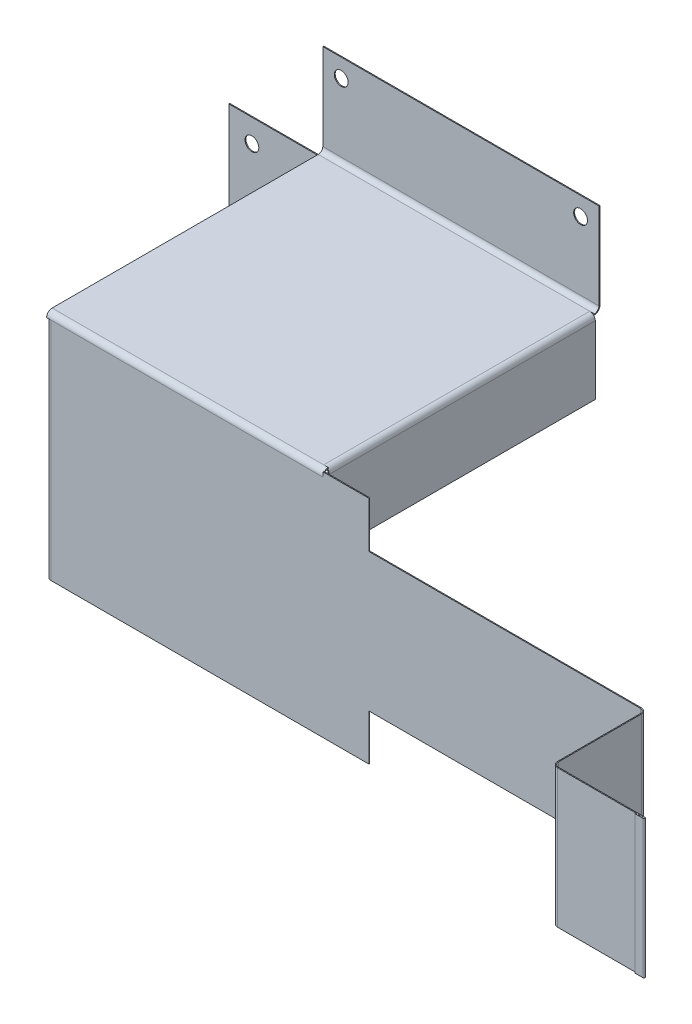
ISO-10303-21;
HEADER;
FILE_DESCRIPTION(('STEP AP214'),'2;1');
FILE_NAME('part.step','',(''),(''),'','','');
FILE_SCHEMA(('AUTOMOTIVE_DESIGN { 1 0 10303 214 1 1 1 1 }'));
ENDSEC;
DATA;
#1=APPLICATION_CONTEXT('core data for automotive mechanical design processes');
#2=APPLICATION_PROTOCOL_DEFINITION('international standard','automotive_design',2000,#1);
#3=PRODUCT_CONTEXT('',#1,'mechanical');
#4=PRODUCT('Part','Part','',(#3));
#5=PRODUCT_RELATED_PRODUCT_CATEGORY('part','',(#4));
#6=PRODUCT_DEFINITION_FORMATION('','',#4);
#7=PRODUCT_DEFINITION_CONTEXT('part definition',#1,'design');
#8=PRODUCT_DEFINITION('design','',#6,#7);
#9=PRODUCT_DEFINITION_SHAPE('','',#8);
#10=(LENGTH_UNIT() NAMED_UNIT(*) SI_UNIT(.MILLI.,.METRE.));
#11=(NAMED_UNIT(*) PLANE_ANGLE_UNIT() SI_UNIT($,.RADIAN.));
#12=(NAMED_UNIT(*) SI_UNIT($,.STERADIAN.) SOLID_ANGLE_UNIT());
#13=UNCERTAINTY_MEASURE_WITH_UNIT(LENGTH_MEASURE(1.E-05),#10,'distance_accuracy_value','');
#14=(GEOMETRIC_REPRESENTATION_CONTEXT(3) GLOBAL_UNCERTAINTY_ASSIGNED_CONTEXT((#13)) GLOBAL_UNIT_ASSIGNED_CONTEXT((#10,
#11,#12)) REPRESENTATION_CONTEXT('',''));
#15=CARTESIAN_POINT('',(0.,0.,0.));
#16=DIRECTION('',(0.,0.,1.));
#17=DIRECTION('',(1.,0.,0.));
#18=AXIS2_PLACEMENT_3D('',#15,#16,#17);
#19=CARTESIAN_POINT('',(125.,125.,-5.99999999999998));
#20=DIRECTION('',(0.,0.,-1.));
#21=DIRECTION('',(-1.,0.,0.));
#22=AXIS2_PLACEMENT_3D('',#19,#20,#21);
#23=PLANE('',#22);
#24=DIRECTION('',(-1.,0.,0.));
#25=VECTOR('',#24,1.);
#26=CARTESIAN_POINT('',(125.,125.,-5.99999999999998));
#27=LINE('',#26,#25);
#28=CARTESIAN_POINT('',(125.,125.,-5.99999999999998));
#29=VERTEX_POINT('',#28);
#30=CARTESIAN_POINT('',(123.316624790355,125.,-6.00000000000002));
#31=VERTEX_POINT('',#30);
#32=EDGE_CURVE('E476',#29,#31,#27,.T.);
#33=ORIENTED_EDGE('',*,*,#32,.T.);
#34=CARTESIAN_POINT('',(120.,120.,-6.00000000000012));
#35=DIRECTION('',(0.,0.,1.));
#36=DIRECTION('',(0.,-1.,0.));
#37=AXIS2_PLACEMENT_3D('',#34,#35,#36);
#38=CIRCLE('',#37,5.99999999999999);
#39=CARTESIAN_POINT('',(120.,126.,-6.00000000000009));
#40=VERTEX_POINT('',#39);
#41=EDGE_CURVE('E11',#31,#40,#38,.T.);
#42=ORIENTED_EDGE('',*,*,#41,.T.);
#43=DIRECTION('',(-1.,0.,0.));
#44=VECTOR('',#43,1.);
#45=CARTESIAN_POINT('',(125.,126.,-5.99999999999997));
#46=LINE('',#45,#44);
#47=CARTESIAN_POINT('',(125.,126.,-5.99999999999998));
#48=VERTEX_POINT('',#47);
#49=EDGE_CURVE('E688',#48,#40,#46,.T.);
#50=ORIENTED_EDGE('',*,*,#49,.F.);
#51=DIRECTION('',(0.,1.,0.));
#52=VECTOR('',#51,1.);
#53=CARTESIAN_POINT('',(125.,125.,-5.99999999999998));
#54=LINE('',#53,#52);
#55=EDGE_CURVE('E699',#29,#48,#54,.T.);
#56=ORIENTED_EDGE('',*,*,#55,.F.);
#57=EDGE_LOOP('',(#33,#42,#50,#56));
#58=FACE_BOUND('',#57,.T.);
#59=ADVANCED_FACE('F35',(#58),#23,.T.);
#60=CARTESIAN_POINT('',(120.,125.000000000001,-295.));
#61=DIRECTION('',(0.,0.,1.));
#62=DIRECTION('',(1.,0.,0.));
#63=AXIS2_PLACEMENT_3D('',#60,#61,#62);
#64=PLANE('',#63);
#65=DIRECTION('',(-1.,0.,0.));
#66=VECTOR('',#65,1.);
#67=CARTESIAN_POINT('',(-175.,126.000000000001,-295.));
#68=LINE('',#67,#66);
#69=CARTESIAN_POINT('',(120.,126.000000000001,-295.));
#70=VERTEX_POINT('',#69);
#71=CARTESIAN_POINT('',(125.,126.000000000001,-295.));
#72=VERTEX_POINT('',#71);
#73=EDGE_CURVE('E712',#70,#72,#68,.F.);
#74=ORIENTED_EDGE('',*,*,#73,.F.);
#75=CARTESIAN_POINT('',(120.,120.000000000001,-295.));
#76=DIRECTION('',(0.,0.,1.));
#77=DIRECTION('',(0.,-1.,0.));
#78=AXIS2_PLACEMENT_3D('',#75,#76,#77);
#79=CIRCLE('',#78,5.99999999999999);
#80=CARTESIAN_POINT('',(123.316624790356,125.000000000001,-295.));
#81=VERTEX_POINT('',#80);
#82=EDGE_CURVE('E463',#70,#81,#79,.F.);
#83=ORIENTED_EDGE('',*,*,#82,.T.);
#84=DIRECTION('',(1.,0.,0.));
#85=VECTOR('',#84,1.);
#86=CARTESIAN_POINT('',(120.,125.000000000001,-295.));
#87=LINE('',#86,#85);
#88=CARTESIAN_POINT('',(125.,125.000000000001,-295.));
#89=VERTEX_POINT('',#88);
#90=EDGE_CURVE('E465',#81,#89,#87,.T.);
#91=ORIENTED_EDGE('',*,*,#90,.T.);
#92=DIRECTION('',(0.,-1.,0.));
#93=VECTOR('',#92,1.);
#94=CARTESIAN_POINT('',(125.,126.000000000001,-295.));
#95=LINE('',#94,#93);
#96=EDGE_CURVE('E698',#72,#89,#95,.T.);
#97=ORIENTED_EDGE('',*,*,#96,.F.);
#98=EDGE_LOOP('',(#74,#83,#91,#97));
#99=FACE_BOUND('',#98,.T.);
#100=ADVANCED_FACE('F924',(#99),#64,.T.);
#101=CARTESIAN_POINT('',(125.,126.,-0.999999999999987));
#102=DIRECTION('',(0.,-1.,0.));
#103=DIRECTION('',(0.,0.,-1.));
#104=AXIS2_PLACEMENT_3D('',#101,#102,#103);
#105=PLANE('',#104);
#106=DIRECTION('',(0.,0.,1.));
#107=VECTOR('',#106,1.);
#108=CARTESIAN_POINT('',(120.,126.,-5.99999999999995));
#109=LINE('',#108,#107);
#110=EDGE_CURVE('E459',#40,#70,#109,.F.);
#111=ORIENTED_EDGE('',*,*,#110,.T.);
#112=CARTESIAN_POINT('',(-175.,126.000000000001,-295.));
#113=VERTEX_POINT('',#112);
#114=EDGE_CURVE('E714',#113,#70,#68,.F.);
#115=ORIENTED_EDGE('',*,*,#114,.F.);
#116=DIRECTION('',(0.,0.,1.));
#117=VECTOR('',#116,1.);
#118=CARTESIAN_POINT('',(-175.,126.,-0.999999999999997));
#119=LINE('',#118,#117);
#120=CARTESIAN_POINT('',(-175.,126.,-5.99999999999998));
#121=VERTEX_POINT('',#120);
#122=EDGE_CURVE('E673',#113,#121,#119,.T.);
#123=ORIENTED_EDGE('',*,*,#122,.T.);
#124=EDGE_CURVE('E693',#40,#121,#46,.T.);
#125=ORIENTED_EDGE('',*,*,#124,.F.);
#126=EDGE_LOOP('',(#111,#115,#123,#125));
#127=FACE_BOUND('',#126,.T.);
#128=ADVANCED_FACE('F930',(#127),#105,.F.);
#129=CARTESIAN_POINT('',(125.,125.,-0.999999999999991));
#130=DIRECTION('',(0.,-1.,0.));
#131=DIRECTION('',(0.,0.,-1.));
#132=AXIS2_PLACEMENT_3D('',#129,#130,#131);
#133=PLANE('',#132);
#134=DIRECTION('',(-1.,0.,0.));
#135=VECTOR('',#134,1.);
#136=CARTESIAN_POINT('',(-175.,125.000000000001,-295.));
#137=LINE('',#136,#135);
#138=CARTESIAN_POINT('',(-175.,125.000000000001,-295.));
#139=VERTEX_POINT('',#138);
#140=CARTESIAN_POINT('',(120.,125.000000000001,-295.));
#141=VERTEX_POINT('',#140);
#142=EDGE_CURVE('E723',#139,#141,#137,.F.);
#143=ORIENTED_EDGE('',*,*,#142,.T.);
#144=DIRECTION('',(0.,0.,1.));
#145=VECTOR('',#144,1.);
#146=CARTESIAN_POINT('',(120.,125.,-5.99999999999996));
#147=LINE('',#146,#145);
#148=CARTESIAN_POINT('',(120.,125.,-6.0000000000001));
#149=VERTEX_POINT('',#148);
#150=EDGE_CURVE('E471',#149,#141,#147,.F.);
#151=ORIENTED_EDGE('',*,*,#150,.F.);
#152=DIRECTION('',(1.,0.,0.));
#153=VECTOR('',#152,1.);
#154=CARTESIAN_POINT('',(-175.,125.,-5.99999999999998));
#155=LINE('',#154,#153);
#156=CARTESIAN_POINT('',(-175.,125.,-5.99999999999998));
#157=VERTEX_POINT('',#156);
#158=EDGE_CURVE('E697',#157,#149,#155,.T.);
#159=ORIENTED_EDGE('',*,*,#158,.F.);
#160=DIRECTION('',(0.,0.,1.));
#161=VECTOR('',#160,1.);
#162=CARTESIAN_POINT('',(-175.,125.,-1.));
#163=LINE('',#162,#161);
#164=EDGE_CURVE('E686',#139,#157,#163,.T.);
#165=ORIENTED_EDGE('',*,*,#164,.F.);
#166=EDGE_LOOP('',(#143,#151,#159,#165));
#167=FACE_BOUND('',#166,.T.);
#168=ADVANCED_FACE('F979',(#167),#133,.T.);
#169=CARTESIAN_POINT('',(476.,-75.,100.));
#170=DIRECTION('',(0.,-1.,0.));
#171=DIRECTION('',(1.,0.,0.));
#172=AXIS2_PLACEMENT_3D('',#169,#170,#171);
#173=PLANE('',#172);
#174=DIRECTION('',(0.,0.,1.));
#175=VECTOR('',#174,1.);
#176=CARTESIAN_POINT('',(476.,-75.,100.));
#177=LINE('',#176,#175);
#178=CARTESIAN_POINT('',(476.,-75.,5.));
#179=VERTEX_POINT('',#178);
#180=CARTESIAN_POINT('',(476.,-75.,95.));
#181=VERTEX_POINT('',#180);
#182=EDGE_CURVE('E530',#179,#181,#177,.T.);
#183=ORIENTED_EDGE('',*,*,#182,.T.);
#184=DIRECTION('',(-1.,0.,0.));
#185=VECTOR('',#184,1.);
#186=CARTESIAN_POINT('',(476.,-74.9999999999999,95.));
#187=LINE('',#186,#185);
#188=CARTESIAN_POINT('',(475.,-74.9999999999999,95.));
#189=VERTEX_POINT('',#188);
#190=EDGE_CURVE('E504',#181,#189,#187,.T.);
#191=ORIENTED_EDGE('',*,*,#190,.T.);
#192=DIRECTION('',(0.,0.,1.));
#193=VECTOR('',#192,1.);
#194=CARTESIAN_POINT('',(475.,-75.,100.));
#195=LINE('',#194,#193);
#196=CARTESIAN_POINT('',(475.,-75.,5.));
#197=VERTEX_POINT('',#196);
#198=EDGE_CURVE('E529',#197,#189,#195,.T.);
#199=ORIENTED_EDGE('',*,*,#198,.F.);
#200=DIRECTION('',(1.,0.,0.));
#201=VECTOR('',#200,1.);
#202=CARTESIAN_POINT('',(475.,-75.,5.));
#203=LINE('',#202,#201);
#204=EDGE_CURVE('E516',#197,#179,#203,.T.);
#205=ORIENTED_EDGE('',*,*,#204,.T.);
#206=EDGE_LOOP('',(#183,#191,#199,#205));
#207=FACE_BOUND('',#206,.T.);
#208=ADVANCED_FACE('F969',(#207),#173,.T.);
#209=CARTESIAN_POINT('',(476.,75.,0.));
#210=DIRECTION('',(1.,0.,0.));
#211=DIRECTION('',(0.,0.,-1.));
#212=AXIS2_PLACEMENT_3D('',#209,#210,#211);
#213=PLANE('',#212);
#214=DIRECTION('',(0.,0.,-1.));
#215=VECTOR('',#214,1.);
#216=CARTESIAN_POINT('',(476.,75.,0.));
#217=LINE('',#216,#215);
#218=CARTESIAN_POINT('',(476.,75.,95.));
#219=VERTEX_POINT('',#218);
#220=CARTESIAN_POINT('',(476.,75.,4.99999999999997));
#221=VERTEX_POINT('',#220);
#222=EDGE_CURVE('E533',#219,#221,#217,.T.);
#223=ORIENTED_EDGE('',*,*,#222,.F.);
#224=DIRECTION('',(0.,-1.,0.));
#225=VECTOR('',#224,1.);
#226=CARTESIAN_POINT('',(476.,-75.,95.));
#227=LINE('',#226,#225);
#228=EDGE_CURVE('E510',#181,#219,#227,.F.);
#229=ORIENTED_EDGE('',*,*,#228,.F.);
#230=ORIENTED_EDGE('',*,*,#182,.F.);
#231=DIRECTION('',(0.,1.,0.));
#232=VECTOR('',#231,1.);
#233=CARTESIAN_POINT('',(476.,75.,4.99999999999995));
#234=LINE('',#233,#232);
#235=EDGE_CURVE('E524',#179,#221,#234,.T.);
#236=ORIENTED_EDGE('',*,*,#235,.T.);
#237=EDGE_LOOP('',(#223,#229,#230,#236));
#238=FACE_BOUND('',#237,.T.);
#239=ADVANCED_FACE('F965',(#238),#213,.T.);
#240=CARTESIAN_POINT('',(475.,75.,0.));
#241=DIRECTION('',(1.,0.,0.));
#242=DIRECTION('',(0.,0.,-1.));
#243=AXIS2_PLACEMENT_3D('',#240,#241,#242);
#244=PLANE('',#243);
#245=DIRECTION('',(0.,-1.,0.));
#246=VECTOR('',#245,1.);
#247=CARTESIAN_POINT('',(475.,-75.,95.));
#248=LINE('',#247,#246);
#249=CARTESIAN_POINT('',(475.,75.,95.));
#250=VERTEX_POINT('',#249);
#251=EDGE_CURVE('E498',#189,#250,#248,.F.);
#252=ORIENTED_EDGE('',*,*,#251,.T.);
#253=DIRECTION('',(0.,0.,-1.));
#254=VECTOR('',#253,1.);
#255=CARTESIAN_POINT('',(475.,75.,0.));
#256=LINE('',#255,#254);
#257=CARTESIAN_POINT('',(475.,75.,4.99999999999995));
#258=VERTEX_POINT('',#257);
#259=EDGE_CURVE('E534',#250,#258,#256,.T.);
#260=ORIENTED_EDGE('',*,*,#259,.T.);
#261=DIRECTION('',(0.,1.,0.));
#262=VECTOR('',#261,1.);
#263=CARTESIAN_POINT('',(475.,-75.,5.));
#264=LINE('',#263,#262);
#265=EDGE_CURVE('E518',#197,#258,#264,.T.);
#266=ORIENTED_EDGE('',*,*,#265,.F.);
#267=ORIENTED_EDGE('',*,*,#198,.T.);
#268=EDGE_LOOP('',(#252,#260,#266,#267));
#269=FACE_BOUND('',#268,.T.);
#270=ADVANCED_FACE('F968',(#269),#244,.F.);
#271=CARTESIAN_POINT('',(175.,125.,-1.));
#272=DIRECTION('',(0.,0.,-1.));
#273=DIRECTION('',(-1.,0.,0.));
#274=AXIS2_PLACEMENT_3D('',#271,#272,#273);
#275=PLANE('',#274);
#276=DIRECTION('',(-1.,0.,0.));
#277=VECTOR('',#276,1.);
#278=CARTESIAN_POINT('',(175.,74.9999999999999,-1.));
#279=LINE('',#278,#277);
#280=CARTESIAN_POINT('',(470.,75.,-1.00000000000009));
#281=VERTEX_POINT('',#280);
#282=CARTESIAN_POINT('',(175.,74.9999999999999,-1.));
#283=VERTEX_POINT('',#282);
#284=EDGE_CURVE('E39',#281,#283,#279,.T.);
#285=ORIENTED_EDGE('',*,*,#284,.F.);
#286=DIRECTION('',(0.,1.,0.));
#287=VECTOR('',#286,1.);
#288=CARTESIAN_POINT('',(470.,75.,-1.00000000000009));
#289=LINE('',#288,#287);
#290=CARTESIAN_POINT('',(470.,-75.,-1.));
#291=VERTEX_POINT('',#290);
#292=EDGE_CURVE('E540',#281,#291,#289,.F.);
#293=ORIENTED_EDGE('',*,*,#292,.T.);
#294=DIRECTION('',(1.,0.,0.));
#295=VECTOR('',#294,1.);
#296=CARTESIAN_POINT('',(175.,-75.,-1.));
#297=LINE('',#296,#295);
#298=CARTESIAN_POINT('',(175.,-75.,-1.));
#299=VERTEX_POINT('',#298);
#300=EDGE_CURVE('E579',#299,#291,#297,.T.);
#301=ORIENTED_EDGE('',*,*,#300,.F.);
#302=DIRECTION('',(0.,1.,0.));
#303=VECTOR('',#302,1.);
#304=CARTESIAN_POINT('',(175.,-125.,-1.));
#305=LINE('',#304,#303);
#306=CARTESIAN_POINT('',(175.,-125.,-1.));
#307=VERTEX_POINT('',#306);
#308=EDGE_CURVE('E613',#307,#299,#305,.T.);
#309=ORIENTED_EDGE('',*,*,#308,.F.);
#310=DIRECTION('',(1.,0.,0.));
#311=VECTOR('',#310,1.);
#312=CARTESIAN_POINT('',(-175.,-125.,-1.));
#313=LINE('',#312,#311);
#314=CARTESIAN_POINT('',(-170.,-125.,-0.999999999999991));
#315=VERTEX_POINT('',#314);
#316=EDGE_CURVE('E629',#315,#307,#313,.T.);
#317=ORIENTED_EDGE('',*,*,#316,.F.);
#318=DIRECTION('',(0.,1.,0.));
#319=VECTOR('',#318,1.);
#320=CARTESIAN_POINT('',(-170.,120.,-0.999999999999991));
#321=LINE('',#320,#319);
#322=CARTESIAN_POINT('',(-170.,120.,-0.999999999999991));
#323=VERTEX_POINT('',#322);
#324=EDGE_CURVE('E783',#323,#315,#321,.F.);
#325=ORIENTED_EDGE('',*,*,#324,.F.);
#326=DIRECTION('',(1.,0.,0.));
#327=VECTOR('',#326,1.);
#328=CARTESIAN_POINT('',(125.,120.,-0.999999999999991));
#329=LINE('',#328,#327);
#330=CARTESIAN_POINT('',(125.,120.,-1.));
#331=VERTEX_POINT('',#330);
#332=EDGE_CURVE('E672',#331,#323,#329,.F.);
#333=ORIENTED_EDGE('',*,*,#332,.F.);
#334=DIRECTION('',(0.,1.,0.));
#335=VECTOR('',#334,1.);
#336=CARTESIAN_POINT('',(125.,119.5,-0.999999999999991));
#337=LINE('',#336,#335);
#338=CARTESIAN_POINT('',(125.,119.5,-1.));
#339=VERTEX_POINT('',#338);
#340=EDGE_CURVE('E653',#339,#331,#337,.T.);
#341=ORIENTED_EDGE('',*,*,#340,.F.);
#342=DIRECTION('',(-1.,0.,0.));
#343=VECTOR('',#342,1.);
#344=CARTESIAN_POINT('',(125.5,119.5,-0.999999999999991));
#345=LINE('',#344,#343);
#346=CARTESIAN_POINT('',(125.5,119.5,-1.));
#347=VERTEX_POINT('',#346);
#348=EDGE_CURVE('E649',#347,#339,#345,.T.);
#349=ORIENTED_EDGE('',*,*,#348,.F.);
#350=DIRECTION('',(0.,-1.,0.));
#351=VECTOR('',#350,1.);
#352=CARTESIAN_POINT('',(125.5,125.,-0.999999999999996));
#353=LINE('',#352,#351);
#354=CARTESIAN_POINT('',(125.5,125.,-1.));
#355=VERTEX_POINT('',#354);
#356=EDGE_CURVE('E648',#355,#347,#353,.T.);
#357=ORIENTED_EDGE('',*,*,#356,.F.);
#358=DIRECTION('',(-1.,0.,0.));
#359=VECTOR('',#358,1.);
#360=CARTESIAN_POINT('',(-175.,125.,-1.));
#361=LINE('',#360,#359);
#362=CARTESIAN_POINT('',(175.,125.,-1.));
#363=VERTEX_POINT('',#362);
#364=EDGE_CURVE('E612',#363,#355,#361,.T.);
#365=ORIENTED_EDGE('',*,*,#364,.F.);
#366=EDGE_CURVE('E589',#283,#363,#305,.T.);
#367=ORIENTED_EDGE('',*,*,#366,.F.);
#368=EDGE_LOOP('',(#285,#293,#301,#309,#317,#325,#333,#341,#349,#357,#365,#367));
#369=FACE_BOUND('',#368,.T.);
#370=ADVANCED_FACE('F610',(#369),#275,.T.);
#371=CARTESIAN_POINT('',(175.,125.,0.));
#372=DIRECTION('',(0.,0.,-1.));
#373=DIRECTION('',(-1.,0.,0.));
#374=AXIS2_PLACEMENT_3D('',#371,#372,#373);
#375=PLANE('',#374);
#376=DIRECTION('',(0.,1.,0.));
#377=VECTOR('',#376,1.);
#378=CARTESIAN_POINT('',(470.,75.,0.));
#379=LINE('',#378,#377);
#380=CARTESIAN_POINT('',(470.,75.,0.));
#381=VERTEX_POINT('',#380);
#382=CARTESIAN_POINT('',(470.,-75.,0.));
#383=VERTEX_POINT('',#382);
#384=EDGE_CURVE('E553',#381,#383,#379,.F.);
#385=ORIENTED_EDGE('',*,*,#384,.F.);
#386=DIRECTION('',(-1.,0.,0.));
#387=VECTOR('',#386,1.);
#388=CARTESIAN_POINT('',(175.,74.9999999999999,0.));
#389=LINE('',#388,#387);
#390=CARTESIAN_POINT('',(175.,74.9999999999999,0.));
#391=VERTEX_POINT('',#390);
#392=EDGE_CURVE('E578',#381,#391,#389,.T.);
#393=ORIENTED_EDGE('',*,*,#392,.T.);
#394=DIRECTION('',(0.,1.,0.));
#395=VECTOR('',#394,1.);
#396=CARTESIAN_POINT('',(175.,-125.,0.));
#397=LINE('',#396,#395);
#398=CARTESIAN_POINT('',(175.,125.,0.));
#399=VERTEX_POINT('',#398);
#400=EDGE_CURVE('E608',#391,#399,#397,.T.);
#401=ORIENTED_EDGE('',*,*,#400,.T.);
#402=DIRECTION('',(-1.,0.,0.));
#403=VECTOR('',#402,1.);
#404=CARTESIAN_POINT('',(-175.,125.,0.));
#405=LINE('',#404,#403);
#406=CARTESIAN_POINT('',(125.5,125.,0.));
#407=VERTEX_POINT('',#406);
#408=EDGE_CURVE('E615',#399,#407,#405,.T.);
#409=ORIENTED_EDGE('',*,*,#408,.T.);
#410=DIRECTION('',(0.,1.,0.));
#411=VECTOR('',#410,1.);
#412=CARTESIAN_POINT('',(125.5,125.,0.));
#413=LINE('',#412,#411);
#414=CARTESIAN_POINT('',(125.5,119.5,0.));
#415=VERTEX_POINT('',#414);
#416=EDGE_CURVE('E635',#415,#407,#413,.T.);
#417=ORIENTED_EDGE('',*,*,#416,.F.);
#418=DIRECTION('',(1.,0.,0.));
#419=VECTOR('',#418,1.);
#420=CARTESIAN_POINT('',(175.,119.5,0.));
#421=LINE('',#420,#419);
#422=CARTESIAN_POINT('',(125.,119.5,0.));
#423=VERTEX_POINT('',#422);
#424=EDGE_CURVE('E632',#423,#415,#421,.T.);
#425=ORIENTED_EDGE('',*,*,#424,.F.);
#426=DIRECTION('',(0.,-1.,0.));
#427=VECTOR('',#426,1.);
#428=CARTESIAN_POINT('',(125.,125.,0.));
#429=LINE('',#428,#427);
#430=CARTESIAN_POINT('',(125.,120.,0.));
#431=VERTEX_POINT('',#430);
#432=EDGE_CURVE('E626',#431,#423,#429,.T.);
#433=ORIENTED_EDGE('',*,*,#432,.F.);
#434=DIRECTION('',(1.,0.,0.));
#435=VECTOR('',#434,1.);
#436=CARTESIAN_POINT('',(125.,120.,0.));
#437=LINE('',#436,#435);
#438=CARTESIAN_POINT('',(-170.,120.,0.));
#439=VERTEX_POINT('',#438);
#440=EDGE_CURVE('E681',#431,#439,#437,.F.);
#441=ORIENTED_EDGE('',*,*,#440,.T.);
#442=DIRECTION('',(0.,1.,0.));
#443=VECTOR('',#442,1.);
#444=CARTESIAN_POINT('',(-170.,120.,0.));
#445=LINE('',#444,#443);
#446=CARTESIAN_POINT('',(-170.,-125.,0.));
#447=VERTEX_POINT('',#446);
#448=EDGE_CURVE('E793',#439,#447,#445,.F.);
#449=ORIENTED_EDGE('',*,*,#448,.T.);
#450=DIRECTION('',(1.,0.,0.));
#451=VECTOR('',#450,1.);
#452=CARTESIAN_POINT('',(-175.,-125.,0.));
#453=LINE('',#452,#451);
#454=CARTESIAN_POINT('',(175.,-125.,0.));
#455=VERTEX_POINT('',#454);
#456=EDGE_CURVE('E614',#447,#455,#453,.T.);
#457=ORIENTED_EDGE('',*,*,#456,.T.);
#458=CARTESIAN_POINT('',(175.,-75.,0.));
#459=VERTEX_POINT('',#458);
#460=EDGE_CURVE('E620',#455,#459,#397,.T.);
#461=ORIENTED_EDGE('',*,*,#460,.T.);
#462=DIRECTION('',(1.,0.,0.));
#463=VECTOR('',#462,1.);
#464=CARTESIAN_POINT('',(175.,-75.,0.));
#465=LINE('',#464,#463);
#466=EDGE_CURVE('E560',#459,#383,#465,.T.);
#467=ORIENTED_EDGE('',*,*,#466,.T.);
#468=EDGE_LOOP('',(#385,#393,#401,#409,#417,#425,#433,#441,#449,#457,#461,#467));
#469=FACE_BOUND('',#468,.T.);
#470=ADVANCED_FACE('F1000',(#469),#375,.F.);
#471=CARTESIAN_POINT('',(175.,74.9999999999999,-1.));
#472=DIRECTION('',(0.,1.,0.));
#473=DIRECTION('',(-1.,0.,0.));
#474=AXIS2_PLACEMENT_3D('',#471,#472,#473);
#475=PLANE('',#474);
#476=ORIENTED_EDGE('',*,*,#392,.F.);
#477=DIRECTION('',(0.,0.,-1.));
#478=VECTOR('',#477,1.);
#479=CARTESIAN_POINT('',(470.,75.,0.));
#480=LINE('',#479,#478);
#481=EDGE_CURVE('E547',#381,#281,#480,.T.);
#482=ORIENTED_EDGE('',*,*,#481,.T.);
#483=ORIENTED_EDGE('',*,*,#284,.T.);
#484=DIRECTION('',(0.,0.,1.));
#485=VECTOR('',#484,1.);
#486=CARTESIAN_POINT('',(175.,74.9999999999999,-1.));
#487=LINE('',#486,#485);
#488=EDGE_CURVE('E568',#283,#391,#487,.T.);
#489=ORIENTED_EDGE('',*,*,#488,.T.);
#490=EDGE_LOOP('',(#476,#482,#483,#489));
#491=FACE_BOUND('',#490,.T.);
#492=ADVANCED_FACE('F601',(#491),#475,.T.);
#493=CARTESIAN_POINT('',(175.,-125.,-1.));
#494=DIRECTION('',(1.,0.,0.));
#495=DIRECTION('',(0.,0.,-1.));
#496=AXIS2_PLACEMENT_3D('',#493,#494,#495);
#497=PLANE('',#496);
#498=ORIENTED_EDGE('',*,*,#308,.T.);
#499=DIRECTION('',(0.,0.,1.));
#500=VECTOR('',#499,1.);
#501=CARTESIAN_POINT('',(175.,-75.,-1.));
#502=LINE('',#501,#500);
#503=EDGE_CURVE('E572',#299,#459,#502,.T.);
#504=ORIENTED_EDGE('',*,*,#503,.T.);
#505=ORIENTED_EDGE('',*,*,#460,.F.);
#506=DIRECTION('',(0.,0.,1.));
#507=VECTOR('',#506,1.);
#508=CARTESIAN_POINT('',(175.,-125.,-1.));
#509=LINE('',#508,#507);
#510=EDGE_CURVE('E624',#307,#455,#509,.T.);
#511=ORIENTED_EDGE('',*,*,#510,.F.);
#512=EDGE_LOOP('',(#498,#504,#505,#511));
#513=FACE_BOUND('',#512,.T.);
#514=ADVANCED_FACE('F999',(#513),#497,.T.);
#515=CARTESIAN_POINT('',(-176.000000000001,-125.,-300.));
#516=DIRECTION('',(0.,-1.,0.));
#517=DIRECTION('',(0.,0.,-1.));
#518=AXIS2_PLACEMENT_3D('',#515,#516,#517);
#519=PLANE('',#518);
#520=DIRECTION('',(0.,0.,-1.));
#521=VECTOR('',#520,1.);
#522=CARTESIAN_POINT('',(-176.000000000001,-125.,-300.));
#523=LINE('',#522,#521);
#524=CARTESIAN_POINT('',(-176.,-125.,-5.99999999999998));
#525=VERTEX_POINT('',#524);
#526=CARTESIAN_POINT('',(-176.000000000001,-125.,-295.));
#527=VERTEX_POINT('',#526);
#528=EDGE_CURVE('E799',#525,#527,#523,.T.);
#529=ORIENTED_EDGE('',*,*,#528,.T.);
#530=DIRECTION('',(1.,0.,0.));
#531=VECTOR('',#530,1.);
#532=CARTESIAN_POINT('',(-176.000000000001,-125.,-295.));
#533=LINE('',#532,#531);
#534=CARTESIAN_POINT('',(-175.000000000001,-125.,-295.));
#535=VERTEX_POINT('',#534);
#536=EDGE_CURVE('E819',#527,#535,#533,.T.);
#537=ORIENTED_EDGE('',*,*,#536,.T.);
#538=DIRECTION('',(0.,0.,-1.));
#539=VECTOR('',#538,1.);
#540=CARTESIAN_POINT('',(-175.000000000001,-125.,-300.));
#541=LINE('',#540,#539);
#542=CARTESIAN_POINT('',(-175.,-125.,-5.99999999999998));
#543=VERTEX_POINT('',#542);
#544=EDGE_CURVE('E800',#543,#535,#541,.T.);
#545=ORIENTED_EDGE('',*,*,#544,.F.);
#546=DIRECTION('',(-1.,0.,0.));
#547=VECTOR('',#546,1.);
#548=CARTESIAN_POINT('',(-175.,-125.,-5.99999999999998));
#549=LINE('',#548,#547);
#550=EDGE_CURVE('E810',#543,#525,#549,.T.);
#551=ORIENTED_EDGE('',*,*,#550,.T.);
#552=EDGE_LOOP('',(#529,#537,#545,#551));
#553=FACE_BOUND('',#552,.T.);
#554=ADVANCED_FACE('F1066',(#553),#519,.T.);
#555=CARTESIAN_POINT('',(-176.,120.,-0.999999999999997));
#556=DIRECTION('',(-1.,0.,0.));
#557=DIRECTION('',(0.,0.,1.));
#558=AXIS2_PLACEMENT_3D('',#555,#556,#557);
#559=PLANE('',#558);
#560=DIRECTION('',(0.,0.,1.));
#561=VECTOR('',#560,1.);
#562=CARTESIAN_POINT('',(-176.,120.,-0.999999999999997));
#563=LINE('',#562,#561);
#564=CARTESIAN_POINT('',(-176.000000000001,120.,-295.));
#565=VERTEX_POINT('',#564);
#566=CARTESIAN_POINT('',(-176.,120.,-5.99999999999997));
#567=VERTEX_POINT('',#566);
#568=EDGE_CURVE('E784',#565,#567,#563,.T.);
#569=ORIENTED_EDGE('',*,*,#568,.F.);
#570=DIRECTION('',(0.,-1.,0.));
#571=VECTOR('',#570,1.);
#572=CARTESIAN_POINT('',(-176.000000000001,-125.,-295.));
#573=LINE('',#572,#571);
#574=EDGE_CURVE('E827',#527,#565,#573,.F.);
#575=ORIENTED_EDGE('',*,*,#574,.F.);
#576=ORIENTED_EDGE('',*,*,#528,.F.);
#577=DIRECTION('',(0.,1.,0.));
#578=VECTOR('',#577,1.);
#579=CARTESIAN_POINT('',(-176.,120.,-5.99999999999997));
#580=LINE('',#579,#578);
#581=EDGE_CURVE('E803',#525,#567,#580,.T.);
#582=ORIENTED_EDGE('',*,*,#581,.T.);
#583=EDGE_LOOP('',(#569,#575,#576,#582));
#584=FACE_BOUND('',#583,.T.);
#585=ADVANCED_FACE('F1587',(#584),#559,.T.);
#586=CARTESIAN_POINT('',(-175.,120.,-1.));
#587=DIRECTION('',(-1.,0.,0.));
#588=DIRECTION('',(0.,0.,1.));
#589=AXIS2_PLACEMENT_3D('',#586,#587,#588);
#590=PLANE('',#589);
#591=DIRECTION('',(0.,-1.,0.));
#592=VECTOR('',#591,1.);
#593=CARTESIAN_POINT('',(-175.000000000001,-125.,-295.));
#594=LINE('',#593,#592);
#595=CARTESIAN_POINT('',(-175.000000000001,120.,-295.));
#596=VERTEX_POINT('',#595);
#597=EDGE_CURVE('E837',#535,#596,#594,.F.);
#598=ORIENTED_EDGE('',*,*,#597,.T.);
#599=DIRECTION('',(0.,0.,1.));
#600=VECTOR('',#599,1.);
#601=CARTESIAN_POINT('',(-175.,120.,-1.));
#602=LINE('',#601,#600);
#603=CARTESIAN_POINT('',(-175.,120.,-5.99999999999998));
#604=VERTEX_POINT('',#603);
#605=EDGE_CURVE('E797',#596,#604,#602,.T.);
#606=ORIENTED_EDGE('',*,*,#605,.T.);
#607=DIRECTION('',(0.,1.,0.));
#608=VECTOR('',#607,1.);
#609=CARTESIAN_POINT('',(-175.,-125.,-5.99999999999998));
#610=LINE('',#609,#608);
#611=EDGE_CURVE('E813',#543,#604,#610,.T.);
#612=ORIENTED_EDGE('',*,*,#611,.F.);
#613=ORIENTED_EDGE('',*,*,#544,.T.);
#614=EDGE_LOOP('',(#598,#606,#612,#613));
#615=FACE_BOUND('',#614,.T.);
#616=ADVANCED_FACE('F1688',(#615),#590,.F.);
#617=CARTESIAN_POINT('',(-175.,120.,-1.));
#618=DIRECTION('',(0.,-1.,0.));
#619=DIRECTION('',(0.,0.,-1.));
#620=AXIS2_PLACEMENT_3D('',#617,#618,#619);
#621=PLANE('',#620);
#622=DIRECTION('',(1.,0.,0.));
#623=VECTOR('',#622,1.);
#624=CARTESIAN_POINT('',(-175.,120.,-1.));
#625=LINE('',#624,#623);
#626=CARTESIAN_POINT('',(-175.,120.,-1.));
#627=VERTEX_POINT('',#626);
#628=CARTESIAN_POINT('',(-173.316624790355,120.,-0.999999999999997));
#629=VERTEX_POINT('',#628);
#630=EDGE_CURVE('E772',#627,#629,#625,.T.);
#631=ORIENTED_EDGE('',*,*,#630,.T.);
#632=CARTESIAN_POINT('',(-170.,120.,-6.));
#633=DIRECTION('',(0.,1.,0.));
#634=DIRECTION('',(0.,0.,1.));
#635=AXIS2_PLACEMENT_3D('',#632,#633,#634);
#636=CIRCLE('',#635,6.);
#637=EDGE_CURVE('E45',#629,#439,#636,.T.);
#638=ORIENTED_EDGE('',*,*,#637,.T.);
#639=DIRECTION('',(1.,0.,0.));
#640=VECTOR('',#639,1.);
#641=CARTESIAN_POINT('',(125.,120.,0.));
#642=LINE('',#641,#640);
#643=CARTESIAN_POINT('',(-175.,120.,0.));
#644=VERTEX_POINT('',#643);
#645=EDGE_CURVE('E766',#644,#439,#642,.T.);
#646=ORIENTED_EDGE('',*,*,#645,.F.);
#647=DIRECTION('',(0.,0.,1.));
#648=VECTOR('',#647,1.);
#649=CARTESIAN_POINT('',(-175.,120.,-0.999999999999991));
#650=LINE('',#649,#648);
#651=EDGE_CURVE('E657',#627,#644,#650,.T.);
#652=ORIENTED_EDGE('',*,*,#651,.F.);
#653=EDGE_LOOP('',(#631,#638,#646,#652));
#654=FACE_BOUND('',#653,.T.);
#655=ADVANCED_FACE('F1602',(#654),#621,.T.);
#656=CARTESIAN_POINT('',(-175.,126.,-0.999999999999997));
#657=DIRECTION('',(1.,0.,0.));
#658=DIRECTION('',(0.,0.,-1.));
#659=AXIS2_PLACEMENT_3D('',#656,#657,#658);
#660=PLANE('',#659);
#661=DIRECTION('',(0.,-1.,0.));
#662=VECTOR('',#661,1.);
#663=CARTESIAN_POINT('',(-175.,126.000000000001,-295.));
#664=LINE('',#663,#662);
#665=EDGE_CURVE('E703',#113,#139,#664,.T.);
#666=ORIENTED_EDGE('',*,*,#665,.T.);
#667=ORIENTED_EDGE('',*,*,#164,.T.);
#668=DIRECTION('',(0.,1.,0.));
#669=VECTOR('',#668,1.);
#670=CARTESIAN_POINT('',(-175.,125.,-5.99999999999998));
#671=LINE('',#670,#669);
#672=EDGE_CURVE('E694',#157,#121,#671,.T.);
#673=ORIENTED_EDGE('',*,*,#672,.T.);
#674=ORIENTED_EDGE('',*,*,#122,.F.);
#675=EDGE_LOOP('',(#666,#667,#673,#674));
#676=FACE_BOUND('',#675,.T.);
#677=ADVANCED_FACE('F1613',(#676),#660,.F.);
#678=CARTESIAN_POINT('',(-175.,125.,-1.));
#679=DIRECTION('',(0.,1.,0.));
#680=DIRECTION('',(0.,0.,1.));
#681=AXIS2_PLACEMENT_3D('',#678,#679,#680);
#682=PLANE('',#681);
#683=ORIENTED_EDGE('',*,*,#364,.T.);
#684=DIRECTION('',(0.,0.,1.));
#685=VECTOR('',#684,1.);
#686=CARTESIAN_POINT('',(125.5,125.,-0.999999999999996));
#687=LINE('',#686,#685);
#688=EDGE_CURVE('E645',#355,#407,#687,.T.);
#689=ORIENTED_EDGE('',*,*,#688,.T.);
#690=ORIENTED_EDGE('',*,*,#408,.F.);
#691=DIRECTION('',(0.,0.,1.));
#692=VECTOR('',#691,1.);
#693=CARTESIAN_POINT('',(175.,125.,-1.));
#694=LINE('',#693,#692);
#695=EDGE_CURVE('E627',#363,#399,#694,.T.);
#696=ORIENTED_EDGE('',*,*,#695,.F.);
#697=EDGE_LOOP('',(#683,#689,#690,#696));
#698=FACE_BOUND('',#697,.T.);
#699=ADVANCED_FACE('F1076',(#698),#682,.T.);
#700=ORIENTED_EDGE('',*,*,#488,.F.);
#701=ORIENTED_EDGE('',*,*,#366,.T.);
#702=ORIENTED_EDGE('',*,*,#695,.T.);
#703=ORIENTED_EDGE('',*,*,#400,.F.);
#704=EDGE_LOOP('',(#700,#701,#702,#703));
#705=FACE_BOUND('',#704,.T.);
#706=ADVANCED_FACE('F37',(#705),#497,.T.);
#707=CARTESIAN_POINT('',(-175.,-125.,-1.));
#708=DIRECTION('',(0.,-1.,0.));
#709=DIRECTION('',(0.,0.,-1.));
#710=AXIS2_PLACEMENT_3D('',#707,#708,#709);
#711=PLANE('',#710);
#712=DIRECTION('',(0.,0.,1.));
#713=VECTOR('',#712,1.);
#714=CARTESIAN_POINT('',(-170.,-125.,-0.999999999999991));
#715=LINE('',#714,#713);
#716=EDGE_CURVE('E776',#315,#447,#715,.T.);
#717=ORIENTED_EDGE('',*,*,#716,.F.);
#718=ORIENTED_EDGE('',*,*,#316,.T.);
#719=ORIENTED_EDGE('',*,*,#510,.T.);
#720=ORIENTED_EDGE('',*,*,#456,.F.);
#721=EDGE_LOOP('',(#717,#718,#719,#720));
#722=FACE_BOUND('',#721,.T.);
#723=ADVANCED_FACE('F1075',(#722),#711,.T.);
#724=CARTESIAN_POINT('',(125.5,125.,-0.999999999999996));
#725=DIRECTION('',(-1.,0.,0.));
#726=DIRECTION('',(0.,-1.,0.));
#727=AXIS2_PLACEMENT_3D('',#724,#725,#726);
#728=PLANE('',#727);
#729=DIRECTION('',(0.,0.,1.));
#730=VECTOR('',#729,1.);
#731=CARTESIAN_POINT('',(125.5,119.5,-0.999999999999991));
#732=LINE('',#731,#730);
#733=EDGE_CURVE('E650',#347,#415,#732,.T.);
#734=ORIENTED_EDGE('',*,*,#733,.T.);
#735=ORIENTED_EDGE('',*,*,#416,.T.);
#736=ORIENTED_EDGE('',*,*,#688,.F.);
#737=ORIENTED_EDGE('',*,*,#356,.T.);
#738=EDGE_LOOP('',(#734,#735,#736,#737));
#739=FACE_BOUND('',#738,.T.);
#740=ADVANCED_FACE('F1641',(#739),#728,.T.);
#741=CARTESIAN_POINT('',(125.5,119.5,-0.999999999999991));
#742=DIRECTION('',(0.,1.,0.));
#743=DIRECTION('',(0.,0.,1.));
#744=AXIS2_PLACEMENT_3D('',#741,#742,#743);
#745=PLANE('',#744);
#746=DIRECTION('',(0.,0.,1.));
#747=VECTOR('',#746,1.);
#748=CARTESIAN_POINT('',(125.,119.5,-0.999999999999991));
#749=LINE('',#748,#747);
#750=EDGE_CURVE('E654',#339,#423,#749,.T.);
#751=ORIENTED_EDGE('',*,*,#750,.T.);
#752=ORIENTED_EDGE('',*,*,#424,.T.);
#753=ORIENTED_EDGE('',*,*,#733,.F.);
#754=ORIENTED_EDGE('',*,*,#348,.T.);
#755=EDGE_LOOP('',(#751,#752,#753,#754));
#756=FACE_BOUND('',#755,.T.);
#757=ADVANCED_FACE('F1639',(#756),#745,.T.);
#758=CARTESIAN_POINT('',(125.,119.5,-0.999999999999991));
#759=DIRECTION('',(1.,0.,0.));
#760=DIRECTION('',(0.,0.,-1.));
#761=AXIS2_PLACEMENT_3D('',#758,#759,#760);
#762=PLANE('',#761);
#763=DIRECTION('',(0.,0.,1.));
#764=VECTOR('',#763,1.);
#765=CARTESIAN_POINT('',(125.,120.,-0.999999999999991));
#766=LINE('',#765,#764);
#767=EDGE_CURVE('E664',#331,#431,#766,.T.);
#768=ORIENTED_EDGE('',*,*,#767,.T.);
#769=ORIENTED_EDGE('',*,*,#432,.T.);
#770=ORIENTED_EDGE('',*,*,#750,.F.);
#771=ORIENTED_EDGE('',*,*,#340,.T.);
#772=EDGE_LOOP('',(#768,#769,#770,#771));
#773=FACE_BOUND('',#772,.T.);
#774=ADVANCED_FACE('F1635',(#773),#762,.T.);
#775=CARTESIAN_POINT('',(-175.,120.,-6.));
#776=DIRECTION('',(-1.,0.,0.));
#777=DIRECTION('',(0.,0.,1.));
#778=AXIS2_PLACEMENT_3D('',#775,#776,#777);
#779=PLANE('',#778);
#780=ORIENTED_EDGE('',*,*,#672,.F.);
#781=CARTESIAN_POINT('',(-175.,120.,-6.));
#782=DIRECTION('',(1.,0.,0.));
#783=DIRECTION('',(0.,0.,-1.));
#784=AXIS2_PLACEMENT_3D('',#781,#782,#783);
#785=CIRCLE('',#784,5.);
#786=EDGE_CURVE('E675',#627,#157,#785,.F.);
#787=ORIENTED_EDGE('',*,*,#786,.F.);
#788=ORIENTED_EDGE('',*,*,#651,.T.);
#789=CARTESIAN_POINT('',(-175.,120.,-6.));
#790=DIRECTION('',(1.,0.,0.));
#791=DIRECTION('',(0.,0.,-1.));
#792=AXIS2_PLACEMENT_3D('',#789,#790,#791);
#793=CIRCLE('',#792,6.);
#794=EDGE_CURVE('E666',#644,#121,#793,.F.);
#795=ORIENTED_EDGE('',*,*,#794,.T.);
#796=EDGE_LOOP('',(#780,#787,#788,#795));
#797=FACE_BOUND('',#796,.T.);
#798=ADVANCED_FACE('F1234',(#797),#779,.T.);
#799=CARTESIAN_POINT('',(125.,120.,-6.));
#800=DIRECTION('',(-1.,0.,0.));
#801=DIRECTION('',(0.,0.,1.));
#802=AXIS2_PLACEMENT_3D('',#799,#800,#801);
#803=PLANE('',#802);
#804=CARTESIAN_POINT('',(125.,120.,-6.));
#805=DIRECTION('',(1.,0.,0.));
#806=DIRECTION('',(0.,0.,-1.));
#807=AXIS2_PLACEMENT_3D('',#804,#805,#806);
#808=CIRCLE('',#807,5.);
#809=EDGE_CURVE('E669',#29,#331,#808,.T.);
#810=ORIENTED_EDGE('',*,*,#809,.F.);
#811=ORIENTED_EDGE('',*,*,#55,.T.);
#812=CARTESIAN_POINT('',(125.,120.,-6.));
#813=DIRECTION('',(1.,0.,0.));
#814=DIRECTION('',(0.,0.,-1.));
#815=AXIS2_PLACEMENT_3D('',#812,#813,#814);
#816=CIRCLE('',#815,6.);
#817=EDGE_CURVE('E678',#48,#431,#816,.T.);
#818=ORIENTED_EDGE('',*,*,#817,.T.);
#819=ORIENTED_EDGE('',*,*,#767,.F.);
#820=EDGE_LOOP('',(#810,#811,#818,#819));
#821=FACE_BOUND('',#820,.T.);
#822=ADVANCED_FACE('F1228',(#821),#803,.F.);
#823=CARTESIAN_POINT('',(125.,120.,-6.));
#824=DIRECTION('',(1.,0.,0.));
#825=DIRECTION('',(0.,1.,0.));
#826=AXIS2_PLACEMENT_3D('',#823,#824,#825);
#827=CYLINDRICAL_SURFACE('',#826,6.);
#828=ORIENTED_EDGE('',*,*,#440,.F.);
#829=ORIENTED_EDGE('',*,*,#817,.F.);
#830=ORIENTED_EDGE('',*,*,#49,.T.);
#831=ORIENTED_EDGE('',*,*,#124,.T.);
#832=ORIENTED_EDGE('',*,*,#794,.F.);
#833=ORIENTED_EDGE('',*,*,#645,.T.);
#834=EDGE_LOOP('',(#828,#829,#830,#831,#832,#833));
#835=FACE_BOUND('',#834,.T.);
#836=ADVANCED_FACE('F1233',(#835),#827,.T.);
#837=CARTESIAN_POINT('',(125.,120.,-6.));
#838=DIRECTION('',(1.,0.,0.));
#839=DIRECTION('',(0.,1.,0.));
#840=AXIS2_PLACEMENT_3D('',#837,#838,#839);
#841=CYLINDRICAL_SURFACE('',#840,5.);
#842=ORIENTED_EDGE('',*,*,#332,.T.);
#843=EDGE_CURVE('E775',#629,#323,#625,.T.);
#844=ORIENTED_EDGE('',*,*,#843,.F.);
#845=ORIENTED_EDGE('',*,*,#630,.F.);
#846=ORIENTED_EDGE('',*,*,#786,.T.);
#847=ORIENTED_EDGE('',*,*,#158,.T.);
#848=EDGE_CURVE('E54',#31,#149,#27,.T.);
#849=ORIENTED_EDGE('',*,*,#848,.F.);
#850=ORIENTED_EDGE('',*,*,#32,.F.);
#851=ORIENTED_EDGE('',*,*,#809,.T.);
#852=EDGE_LOOP('',(#842,#844,#845,#846,#847,#849,#850,#851));
#853=FACE_BOUND('',#852,.T.);
#854=ADVANCED_FACE('F1247',(#853),#841,.F.);
#855=CARTESIAN_POINT('',(125.,131.000000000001,-295.));
#856=DIRECTION('',(1.,0.,0.));
#857=DIRECTION('',(0.,0.,-1.));
#858=AXIS2_PLACEMENT_3D('',#855,#856,#857);
#859=PLANE('',#858);
#860=DIRECTION('',(0.,0.,-1.));
#861=VECTOR('',#860,1.);
#862=CARTESIAN_POINT('',(125.,131.000000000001,-300.));
#863=LINE('',#862,#861);
#864=CARTESIAN_POINT('',(125.,131.000000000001,-300.));
#865=VERTEX_POINT('',#864);
#866=CARTESIAN_POINT('',(125.,131.000000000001,-301.));
#867=VERTEX_POINT('',#866);
#868=EDGE_CURVE('E762',#865,#867,#863,.T.);
#869=ORIENTED_EDGE('',*,*,#868,.F.);
#870=CARTESIAN_POINT('',(125.,131.000000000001,-295.));
#871=DIRECTION('',(-1.,0.,0.));
#872=DIRECTION('',(0.,0.,1.));
#873=AXIS2_PLACEMENT_3D('',#870,#871,#872);
#874=CIRCLE('',#873,5.);
#875=EDGE_CURVE('E717',#72,#865,#874,.F.);
#876=ORIENTED_EDGE('',*,*,#875,.F.);
#877=ORIENTED_EDGE('',*,*,#96,.T.);
#878=CARTESIAN_POINT('',(125.,131.000000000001,-295.));
#879=DIRECTION('',(-1.,0.,0.));
#880=DIRECTION('',(0.,0.,1.));
#881=AXIS2_PLACEMENT_3D('',#878,#879,#880);
#882=CIRCLE('',#881,6.);
#883=EDGE_CURVE('E706',#89,#867,#882,.F.);
#884=ORIENTED_EDGE('',*,*,#883,.T.);
#885=EDGE_LOOP('',(#869,#876,#877,#884));
#886=FACE_BOUND('',#885,.T.);
#887=ADVANCED_FACE('F1258',(#886),#859,.T.);
#888=CARTESIAN_POINT('',(-175.,131.000000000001,-295.));
#889=DIRECTION('',(1.,0.,0.));
#890=DIRECTION('',(0.,0.,-1.));
#891=AXIS2_PLACEMENT_3D('',#888,#889,#890);
#892=PLANE('',#891);
#893=CARTESIAN_POINT('',(-175.,131.000000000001,-295.));
#894=DIRECTION('',(-1.,0.,0.));
#895=DIRECTION('',(0.,0.,1.));
#896=AXIS2_PLACEMENT_3D('',#893,#894,#895);
#897=CIRCLE('',#896,5.);
#898=CARTESIAN_POINT('',(-175.,131.000000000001,-300.));
#899=VERTEX_POINT('',#898);
#900=EDGE_CURVE('E709',#899,#113,#897,.T.);
#901=ORIENTED_EDGE('',*,*,#900,.F.);
#902=DIRECTION('',(0.,0.,-1.));
#903=VECTOR('',#902,1.);
#904=CARTESIAN_POINT('',(-175.,131.000000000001,-300.));
#905=LINE('',#904,#903);
#906=CARTESIAN_POINT('',(-175.,131.000000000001,-301.));
#907=VERTEX_POINT('',#906);
#908=EDGE_CURVE('E761',#899,#907,#905,.T.);
#909=ORIENTED_EDGE('',*,*,#908,.T.);
#910=CARTESIAN_POINT('',(-175.,131.000000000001,-295.));
#911=DIRECTION('',(-1.,0.,0.));
#912=DIRECTION('',(0.,0.,1.));
#913=AXIS2_PLACEMENT_3D('',#910,#911,#912);
#914=CIRCLE('',#913,6.);
#915=EDGE_CURVE('E720',#907,#139,#914,.T.);
#916=ORIENTED_EDGE('',*,*,#915,.T.);
#917=ORIENTED_EDGE('',*,*,#665,.F.);
#918=EDGE_LOOP('',(#901,#909,#916,#917));
#919=FACE_BOUND('',#918,.T.);
#920=ADVANCED_FACE('F1269',(#919),#892,.F.);
#921=CARTESIAN_POINT('',(-175.,131.000000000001,-295.));
#922=DIRECTION('',(-1.,0.,0.));
#923=DIRECTION('',(0.,0.,-1.));
#924=AXIS2_PLACEMENT_3D('',#921,#922,#923);
#925=CYLINDRICAL_SURFACE('',#924,6.);
#926=ORIENTED_EDGE('',*,*,#142,.F.);
#927=ORIENTED_EDGE('',*,*,#915,.F.);
#928=DIRECTION('',(1.,0.,0.));
#929=VECTOR('',#928,1.);
#930=CARTESIAN_POINT('',(-175.,131.000000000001,-301.));
#931=LINE('',#930,#929);
#932=EDGE_CURVE('E757',#907,#867,#931,.T.);
#933=ORIENTED_EDGE('',*,*,#932,.T.);
#934=ORIENTED_EDGE('',*,*,#883,.F.);
#935=ORIENTED_EDGE('',*,*,#90,.F.);
#936=EDGE_CURVE('E479',#141,#81,#87,.T.);
#937=ORIENTED_EDGE('',*,*,#936,.F.);
#938=EDGE_LOOP('',(#926,#927,#933,#934,#935,#937));
#939=FACE_BOUND('',#938,.T.);
#940=ADVANCED_FACE('F1278',(#939),#925,.T.);
#941=CARTESIAN_POINT('',(-175.,131.000000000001,-295.));
#942=DIRECTION('',(-1.,0.,0.));
#943=DIRECTION('',(0.,0.,-1.));
#944=AXIS2_PLACEMENT_3D('',#941,#942,#943);
#945=CYLINDRICAL_SURFACE('',#944,5.);
#946=ORIENTED_EDGE('',*,*,#114,.T.);
#947=ORIENTED_EDGE('',*,*,#73,.T.);
#948=ORIENTED_EDGE('',*,*,#875,.T.);
#949=DIRECTION('',(-1.,0.,0.));
#950=VECTOR('',#949,1.);
#951=CARTESIAN_POINT('',(125.,131.000000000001,-300.));
#952=LINE('',#951,#950);
#953=EDGE_CURVE('E765',#865,#899,#952,.T.);
#954=ORIENTED_EDGE('',*,*,#953,.T.);
#955=ORIENTED_EDGE('',*,*,#900,.T.);
#956=EDGE_LOOP('',(#946,#947,#948,#954,#955));
#957=FACE_BOUND('',#956,.T.);
#958=ADVANCED_FACE('F1283',(#957),#945,.F.);
#959=CARTESIAN_POINT('',(-175.,126.000000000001,-301.));
#960=DIRECTION('',(0.,0.,1.));
#961=DIRECTION('',(1.,0.,0.));
#962=AXIS2_PLACEMENT_3D('',#959,#960,#961);
#963=PLANE('',#962);
#964=CARTESIAN_POINT('',(105.,205.000000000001,-301.));
#965=DIRECTION('',(0.,0.,-1.));
#966=DIRECTION('',(0.,1.,0.));
#967=AXIS2_PLACEMENT_3D('',#964,#965,#966);
#968=CIRCLE('',#967,7.50000000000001);
#969=CARTESIAN_POINT('',(105.,212.500000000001,-301.));
#970=VERTEX_POINT('',#969);
#971=EDGE_CURVE('E751',#970,#970,#968,.T.);
#972=ORIENTED_EDGE('',*,*,#971,.F.);
#973=EDGE_LOOP('',(#972));
#974=FACE_BOUND('',#973,.T.);
#975=CARTESIAN_POINT('',(-155.,205.000000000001,-301.));
#976=DIRECTION('',(0.,0.,-1.));
#977=DIRECTION('',(0.,1.,0.));
#978=AXIS2_PLACEMENT_3D('',#975,#976,#977);
#979=CIRCLE('',#978,7.50000000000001);
#980=CARTESIAN_POINT('',(-155.,212.500000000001,-301.));
#981=VERTEX_POINT('',#980);
#982=EDGE_CURVE('E742',#981,#981,#979,.T.);
#983=ORIENTED_EDGE('',*,*,#982,.F.);
#984=EDGE_LOOP('',(#983));
#985=FACE_BOUND('',#984,.T.);
#986=ORIENTED_EDGE('',*,*,#932,.F.);
#987=DIRECTION('',(0.,1.,0.));
#988=VECTOR('',#987,1.);
#989=CARTESIAN_POINT('',(-175.,225.000000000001,-301.));
#990=LINE('',#989,#988);
#991=CARTESIAN_POINT('',(-175.,225.000000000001,-301.));
#992=VERTEX_POINT('',#991);
#993=EDGE_CURVE('E737',#907,#992,#990,.T.);
#994=ORIENTED_EDGE('',*,*,#993,.T.);
#995=DIRECTION('',(1.,0.,0.));
#996=VECTOR('',#995,1.);
#997=CARTESIAN_POINT('',(125.,225.000000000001,-301.));
#998=LINE('',#997,#996);
#999=CARTESIAN_POINT('',(125.,225.000000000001,-301.));
#1000=VERTEX_POINT('',#999);
#1001=EDGE_CURVE('E745',#992,#1000,#998,.T.);
#1002=ORIENTED_EDGE('',*,*,#1001,.T.);
#1003=DIRECTION('',(0.,-1.,0.));
#1004=VECTOR('',#1003,1.);
#1005=CARTESIAN_POINT('',(125.,126.000000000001,-301.));
#1006=LINE('',#1005,#1004);
#1007=EDGE_CURVE('E733',#1000,#867,#1006,.T.);
#1008=ORIENTED_EDGE('',*,*,#1007,.T.);
#1009=EDGE_LOOP('',(#986,#994,#1002,#1008));
#1010=FACE_BOUND('',#1009,.T.);
#1011=ADVANCED_FACE('F1294',(#974,#985,#1010),#963,.F.);
#1012=CARTESIAN_POINT('',(-175.,126.000000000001,-300.));
#1013=DIRECTION('',(0.,0.,1.));
#1014=DIRECTION('',(1.,0.,0.));
#1015=AXIS2_PLACEMENT_3D('',#1012,#1013,#1014);
#1016=PLANE('',#1015);
#1017=CARTESIAN_POINT('',(-155.,205.000000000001,-300.));
#1018=DIRECTION('',(0.,0.,-1.));
#1019=DIRECTION('',(0.,1.,0.));
#1020=AXIS2_PLACEMENT_3D('',#1017,#1018,#1019);
#1021=CIRCLE('',#1020,7.50000000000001);
#1022=CARTESIAN_POINT('',(-155.,212.500000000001,-300.));
#1023=VERTEX_POINT('',#1022);
#1024=EDGE_CURVE('E748',#1023,#1023,#1021,.T.);
#1025=ORIENTED_EDGE('',*,*,#1024,.T.);
#1026=EDGE_LOOP('',(#1025));
#1027=FACE_BOUND('',#1026,.T.);
#1028=CARTESIAN_POINT('',(105.,205.000000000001,-300.));
#1029=DIRECTION('',(0.,0.,-1.));
#1030=DIRECTION('',(0.,1.,0.));
#1031=AXIS2_PLACEMENT_3D('',#1028,#1029,#1030);
#1032=CIRCLE('',#1031,7.50000000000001);
#1033=CARTESIAN_POINT('',(105.,212.500000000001,-300.));
#1034=VERTEX_POINT('',#1033);
#1035=EDGE_CURVE('E754',#1034,#1034,#1032,.T.);
#1036=ORIENTED_EDGE('',*,*,#1035,.T.);
#1037=EDGE_LOOP('',(#1036));
#1038=FACE_BOUND('',#1037,.T.);
#1039=DIRECTION('',(0.,1.,0.));
#1040=VECTOR('',#1039,1.);
#1041=CARTESIAN_POINT('',(-175.,225.000000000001,-300.));
#1042=LINE('',#1041,#1040);
#1043=CARTESIAN_POINT('',(-175.,225.000000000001,-300.));
#1044=VERTEX_POINT('',#1043);
#1045=EDGE_CURVE('E740',#899,#1044,#1042,.T.);
#1046=ORIENTED_EDGE('',*,*,#1045,.F.);
#1047=ORIENTED_EDGE('',*,*,#953,.F.);
#1048=DIRECTION('',(0.,-1.,0.));
#1049=VECTOR('',#1048,1.);
#1050=CARTESIAN_POINT('',(125.,126.000000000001,-300.));
#1051=LINE('',#1050,#1049);
#1052=CARTESIAN_POINT('',(125.,225.000000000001,-300.));
#1053=VERTEX_POINT('',#1052);
#1054=EDGE_CURVE('E734',#1053,#865,#1051,.T.);
#1055=ORIENTED_EDGE('',*,*,#1054,.F.);
#1056=DIRECTION('',(1.,0.,0.));
#1057=VECTOR('',#1056,1.);
#1058=CARTESIAN_POINT('',(125.,225.000000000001,-300.));
#1059=LINE('',#1058,#1057);
#1060=EDGE_CURVE('E738',#1044,#1053,#1059,.T.);
#1061=ORIENTED_EDGE('',*,*,#1060,.F.);
#1062=EDGE_LOOP('',(#1046,#1047,#1055,#1061));
#1063=FACE_BOUND('',#1062,.T.);
#1064=ADVANCED_FACE('F1664',(#1027,#1038,#1063),#1016,.T.);
#1065=CARTESIAN_POINT('',(-175.,225.000000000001,-301.));
#1066=DIRECTION('',(1.,0.,0.));
#1067=DIRECTION('',(0.,0.,-1.));
#1068=AXIS2_PLACEMENT_3D('',#1065,#1066,#1067);
#1069=PLANE('',#1068);
#1070=ORIENTED_EDGE('',*,*,#908,.F.);
#1071=ORIENTED_EDGE('',*,*,#1045,.T.);
#1072=DIRECTION('',(0.,0.,1.));
#1073=VECTOR('',#1072,1.);
#1074=CARTESIAN_POINT('',(-175.,225.000000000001,-301.));
#1075=LINE('',#1074,#1073);
#1076=EDGE_CURVE('E713',#992,#1044,#1075,.T.);
#1077=ORIENTED_EDGE('',*,*,#1076,.F.);
#1078=ORIENTED_EDGE('',*,*,#993,.F.);
#1079=EDGE_LOOP('',(#1070,#1071,#1077,#1078));
#1080=FACE_BOUND('',#1079,.T.);
#1081=ADVANCED_FACE('F1660',(#1080),#1069,.F.);
#1082=CARTESIAN_POINT('',(125.,126.000000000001,-301.));
#1083=DIRECTION('',(-1.,0.,0.));
#1084=DIRECTION('',(0.,0.,1.));
#1085=AXIS2_PLACEMENT_3D('',#1082,#1083,#1084);
#1086=PLANE('',#1085);
#1087=ORIENTED_EDGE('',*,*,#868,.T.);
#1088=ORIENTED_EDGE('',*,*,#1007,.F.);
#1089=DIRECTION('',(0.,0.,1.));
#1090=VECTOR('',#1089,1.);
#1091=CARTESIAN_POINT('',(125.,225.000000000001,-301.));
#1092=LINE('',#1091,#1090);
#1093=EDGE_CURVE('E730',#1000,#1053,#1092,.T.);
#1094=ORIENTED_EDGE('',*,*,#1093,.T.);
#1095=ORIENTED_EDGE('',*,*,#1054,.T.);
#1096=EDGE_LOOP('',(#1087,#1088,#1094,#1095));
#1097=FACE_BOUND('',#1096,.T.);
#1098=ADVANCED_FACE('F1663',(#1097),#1086,.F.);
#1099=CARTESIAN_POINT('',(125.,225.000000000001,-301.));
#1100=DIRECTION('',(0.,-1.,0.));
#1101=DIRECTION('',(0.,0.,-1.));
#1102=AXIS2_PLACEMENT_3D('',#1099,#1100,#1101);
#1103=PLANE('',#1102);
#1104=ORIENTED_EDGE('',*,*,#1060,.T.);
#1105=ORIENTED_EDGE('',*,*,#1093,.F.);
#1106=ORIENTED_EDGE('',*,*,#1001,.F.);
#1107=ORIENTED_EDGE('',*,*,#1076,.T.);
#1108=EDGE_LOOP('',(#1104,#1105,#1106,#1107));
#1109=FACE_BOUND('',#1108,.T.);
#1110=ADVANCED_FACE('F1666',(#1109),#1103,.F.);
#1111=CARTESIAN_POINT('',(-155.,205.000000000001,-301.));
#1112=DIRECTION('',(0.,0.,1.));
#1113=DIRECTION('',(0.,-1.,0.));
#1114=AXIS2_PLACEMENT_3D('',#1111,#1112,#1113);
#1115=CYLINDRICAL_SURFACE('',#1114,7.50000000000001);
#1116=ORIENTED_EDGE('',*,*,#982,.T.);
#1117=EDGE_LOOP('',(#1116));
#1118=FACE_BOUND('',#1117,.T.);
#1119=ORIENTED_EDGE('',*,*,#1024,.F.);
#1120=EDGE_LOOP('',(#1119));
#1121=FACE_BOUND('',#1120,.T.);
#1122=ADVANCED_FACE('F1669',(#1118,#1121),#1115,.F.);
#1123=CARTESIAN_POINT('',(105.,205.000000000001,-301.));
#1124=DIRECTION('',(0.,0.,1.));
#1125=DIRECTION('',(0.,-1.,0.));
#1126=AXIS2_PLACEMENT_3D('',#1123,#1124,#1125);
#1127=CYLINDRICAL_SURFACE('',#1126,7.50000000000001);
#1128=ORIENTED_EDGE('',*,*,#971,.T.);
#1129=EDGE_LOOP('',(#1128));
#1130=FACE_BOUND('',#1129,.T.);
#1131=ORIENTED_EDGE('',*,*,#1035,.F.);
#1132=EDGE_LOOP('',(#1131));
#1133=FACE_BOUND('',#1132,.T.);
#1134=ADVANCED_FACE('F1681',(#1130,#1133),#1127,.F.);
#1135=CARTESIAN_POINT('',(-170.,-125.,-6.));
#1136=DIRECTION('',(0.,-1.,0.));
#1137=DIRECTION('',(0.,0.,-1.));
#1138=AXIS2_PLACEMENT_3D('',#1135,#1136,#1137);
#1139=PLANE('',#1138);
#1140=ORIENTED_EDGE('',*,*,#550,.F.);
#1141=CARTESIAN_POINT('',(-170.,-125.,-6.));
#1142=DIRECTION('',(0.,1.,0.));
#1143=DIRECTION('',(0.,0.,1.));
#1144=AXIS2_PLACEMENT_3D('',#1141,#1142,#1143);
#1145=CIRCLE('',#1144,5.);
#1146=EDGE_CURVE('E787',#315,#543,#1145,.F.);
#1147=ORIENTED_EDGE('',*,*,#1146,.F.);
#1148=ORIENTED_EDGE('',*,*,#716,.T.);
#1149=CARTESIAN_POINT('',(-170.,-125.,-6.));
#1150=DIRECTION('',(0.,1.,0.));
#1151=DIRECTION('',(0.,0.,1.));
#1152=AXIS2_PLACEMENT_3D('',#1149,#1150,#1151);
#1153=CIRCLE('',#1152,6.);
#1154=EDGE_CURVE('E779',#447,#525,#1153,.F.);
#1155=ORIENTED_EDGE('',*,*,#1154,.T.);
#1156=EDGE_LOOP('',(#1140,#1147,#1148,#1155));
#1157=FACE_BOUND('',#1156,.T.);
#1158=ADVANCED_FACE('F1580',(#1157),#1139,.T.);
#1159=CARTESIAN_POINT('',(-170.,120.,-6.));
#1160=DIRECTION('',(0.,-1.,0.));
#1161=DIRECTION('',(0.,0.,-1.));
#1162=AXIS2_PLACEMENT_3D('',#1159,#1160,#1161);
#1163=PLANE('',#1162);
#1164=EDGE_CURVE('E790',#567,#629,#636,.T.);
#1165=ORIENTED_EDGE('',*,*,#1164,.T.);
#1166=ORIENTED_EDGE('',*,*,#843,.T.);
#1167=CARTESIAN_POINT('',(-170.,120.,-6.));
#1168=DIRECTION('',(0.,1.,0.));
#1169=DIRECTION('',(0.,0.,1.));
#1170=AXIS2_PLACEMENT_3D('',#1167,#1168,#1169);
#1171=CIRCLE('',#1170,5.);
#1172=EDGE_CURVE('E780',#604,#323,#1171,.T.);
#1173=ORIENTED_EDGE('',*,*,#1172,.F.);
#1174=DIRECTION('',(-1.,0.,0.));
#1175=VECTOR('',#1174,1.);
#1176=CARTESIAN_POINT('',(-175.,120.,-5.99999999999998));
#1177=LINE('',#1176,#1175);
#1178=EDGE_CURVE('E809',#604,#567,#1177,.T.);
#1179=ORIENTED_EDGE('',*,*,#1178,.T.);
#1180=EDGE_LOOP('',(#1165,#1166,#1173,#1179));
#1181=FACE_BOUND('',#1180,.T.);
#1182=ADVANCED_FACE('F1598',(#1181),#1163,.F.);
#1183=CARTESIAN_POINT('',(-170.,120.,-6.));
#1184=DIRECTION('',(0.,1.,0.));
#1185=DIRECTION('',(-1.,0.,0.));
#1186=AXIS2_PLACEMENT_3D('',#1183,#1184,#1185);
#1187=CYLINDRICAL_SURFACE('',#1186,6.);
#1188=ORIENTED_EDGE('',*,*,#448,.F.);
#1189=ORIENTED_EDGE('',*,*,#637,.F.);
#1190=ORIENTED_EDGE('',*,*,#1164,.F.);
#1191=ORIENTED_EDGE('',*,*,#581,.F.);
#1192=ORIENTED_EDGE('',*,*,#1154,.F.);
#1193=EDGE_LOOP('',(#1188,#1189,#1190,#1191,#1192));
#1194=FACE_BOUND('',#1193,.T.);
#1195=ADVANCED_FACE('F1596',(#1194),#1187,.T.);
#1196=CARTESIAN_POINT('',(-170.,120.,-6.));
#1197=DIRECTION('',(0.,1.,0.));
#1198=DIRECTION('',(-1.,0.,0.));
#1199=AXIS2_PLACEMENT_3D('',#1196,#1197,#1198);
#1200=CYLINDRICAL_SURFACE('',#1199,5.);
#1201=ORIENTED_EDGE('',*,*,#324,.T.);
#1202=ORIENTED_EDGE('',*,*,#1146,.T.);
#1203=ORIENTED_EDGE('',*,*,#611,.T.);
#1204=ORIENTED_EDGE('',*,*,#1172,.T.);
#1205=EDGE_LOOP('',(#1201,#1202,#1203,#1204));
#1206=FACE_BOUND('',#1205,.T.);
#1207=ADVANCED_FACE('F1576',(#1206),#1200,.F.);
#1208=CARTESIAN_POINT('',(-176.,120.,-0.999999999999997));
#1209=DIRECTION('',(0.,1.,0.));
#1210=DIRECTION('',(0.,0.,1.));
#1211=AXIS2_PLACEMENT_3D('',#1208,#1209,#1210);
#1212=PLANE('',#1211);
#1213=DIRECTION('',(1.,0.,0.));
#1214=VECTOR('',#1213,1.);
#1215=CARTESIAN_POINT('',(-176.000000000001,120.,-295.));
#1216=LINE('',#1215,#1214);
#1217=EDGE_CURVE('E814',#565,#596,#1216,.T.);
#1218=ORIENTED_EDGE('',*,*,#1217,.F.);
#1219=ORIENTED_EDGE('',*,*,#568,.T.);
#1220=ORIENTED_EDGE('',*,*,#1178,.F.);
#1221=ORIENTED_EDGE('',*,*,#605,.F.);
#1222=EDGE_LOOP('',(#1218,#1219,#1220,#1221));
#1223=FACE_BOUND('',#1222,.T.);
#1224=ADVANCED_FACE('F1591',(#1223),#1212,.T.);
#1225=CARTESIAN_POINT('',(-181.000000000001,120.,-295.));
#1226=DIRECTION('',(0.,1.,0.));
#1227=DIRECTION('',(0.,0.,1.));
#1228=AXIS2_PLACEMENT_3D('',#1225,#1226,#1227);
#1229=PLANE('',#1228);
#1230=DIRECTION('',(0.,0.,-1.));
#1231=VECTOR('',#1230,1.);
#1232=CARTESIAN_POINT('',(-181.000000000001,120.,-300.));
#1233=LINE('',#1232,#1231);
#1234=CARTESIAN_POINT('',(-181.000000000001,120.,-300.));
#1235=VERTEX_POINT('',#1234);
#1236=CARTESIAN_POINT('',(-181.000000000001,120.,-301.));
#1237=VERTEX_POINT('',#1236);
#1238=EDGE_CURVE('E571',#1235,#1237,#1233,.T.);
#1239=ORIENTED_EDGE('',*,*,#1238,.F.);
#1240=CARTESIAN_POINT('',(-181.000000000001,120.,-295.));
#1241=DIRECTION('',(0.,-1.,0.));
#1242=DIRECTION('',(0.,0.,-1.));
#1243=AXIS2_PLACEMENT_3D('',#1240,#1241,#1242);
#1244=CIRCLE('',#1243,5.);
#1245=EDGE_CURVE('E831',#565,#1235,#1244,.F.);
#1246=ORIENTED_EDGE('',*,*,#1245,.F.);
#1247=ORIENTED_EDGE('',*,*,#1217,.T.);
#1248=CARTESIAN_POINT('',(-181.000000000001,120.,-295.));
#1249=DIRECTION('',(0.,-1.,0.));
#1250=DIRECTION('',(0.,0.,-1.));
#1251=AXIS2_PLACEMENT_3D('',#1248,#1249,#1250);
#1252=CIRCLE('',#1251,6.);
#1253=EDGE_CURVE('E821',#596,#1237,#1252,.F.);
#1254=ORIENTED_EDGE('',*,*,#1253,.T.);
#1255=EDGE_LOOP('',(#1239,#1246,#1247,#1254));
#1256=FACE_BOUND('',#1255,.T.);
#1257=ADVANCED_FACE('F910',(#1256),#1229,.T.);
#1258=CARTESIAN_POINT('',(-181.000000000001,-125.,-295.));
#1259=DIRECTION('',(0.,1.,0.));
#1260=DIRECTION('',(0.,0.,1.));
#1261=AXIS2_PLACEMENT_3D('',#1258,#1259,#1260);
#1262=PLANE('',#1261);
#1263=CARTESIAN_POINT('',(-181.000000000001,-125.,-295.));
#1264=DIRECTION('',(0.,-1.,0.));
#1265=DIRECTION('',(0.,0.,-1.));
#1266=AXIS2_PLACEMENT_3D('',#1263,#1264,#1265);
#1267=CIRCLE('',#1266,5.);
#1268=CARTESIAN_POINT('',(-181.000000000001,-125.,-300.));
#1269=VERTEX_POINT('',#1268);
#1270=EDGE_CURVE('E824',#1269,#527,#1267,.T.);
#1271=ORIENTED_EDGE('',*,*,#1270,.F.);
#1272=DIRECTION('',(0.,0.,-1.));
#1273=VECTOR('',#1272,1.);
#1274=CARTESIAN_POINT('',(-181.000000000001,-125.,-300.));
#1275=LINE('',#1274,#1273);
#1276=CARTESIAN_POINT('',(-181.000000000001,-125.,-301.));
#1277=VERTEX_POINT('',#1276);
#1278=EDGE_CURVE('E874',#1269,#1277,#1275,.T.);
#1279=ORIENTED_EDGE('',*,*,#1278,.T.);
#1280=CARTESIAN_POINT('',(-181.000000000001,-125.,-295.));
#1281=DIRECTION('',(0.,-1.,0.));
#1282=DIRECTION('',(0.,0.,-1.));
#1283=AXIS2_PLACEMENT_3D('',#1280,#1281,#1282);
#1284=CIRCLE('',#1283,6.);
#1285=EDGE_CURVE('E834',#1277,#535,#1284,.T.);
#1286=ORIENTED_EDGE('',*,*,#1285,.T.);
#1287=ORIENTED_EDGE('',*,*,#536,.F.);
#1288=EDGE_LOOP('',(#1271,#1279,#1286,#1287));
#1289=FACE_BOUND('',#1288,.T.);
#1290=ADVANCED_FACE('F890',(#1289),#1262,.F.);
#1291=CARTESIAN_POINT('',(-181.000000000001,-125.,-295.));
#1292=DIRECTION('',(0.,-1.,0.));
#1293=DIRECTION('',(0.,0.,-1.));
#1294=AXIS2_PLACEMENT_3D('',#1291,#1292,#1293);
#1295=CYLINDRICAL_SURFACE('',#1294,6.);
#1296=ORIENTED_EDGE('',*,*,#597,.F.);
#1297=ORIENTED_EDGE('',*,*,#1285,.F.);
#1298=DIRECTION('',(0.,1.,0.));
#1299=VECTOR('',#1298,1.);
#1300=CARTESIAN_POINT('',(-181.000000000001,-125.,-301.));
#1301=LINE('',#1300,#1299);
#1302=EDGE_CURVE('E870',#1277,#1237,#1301,.T.);
#1303=ORIENTED_EDGE('',*,*,#1302,.T.);
#1304=ORIENTED_EDGE('',*,*,#1253,.F.);
#1305=EDGE_LOOP('',(#1296,#1297,#1303,#1304));
#1306=FACE_BOUND('',#1305,.T.);
#1307=ADVANCED_FACE('F908',(#1306),#1295,.T.);
#1308=CARTESIAN_POINT('',(-181.000000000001,-125.,-295.));
#1309=DIRECTION('',(0.,-1.,0.));
#1310=DIRECTION('',(0.,0.,-1.));
#1311=AXIS2_PLACEMENT_3D('',#1308,#1309,#1310);
#1312=CYLINDRICAL_SURFACE('',#1311,5.);
#1313=ORIENTED_EDGE('',*,*,#574,.T.);
#1314=ORIENTED_EDGE('',*,*,#1245,.T.);
#1315=DIRECTION('',(0.,-1.,0.));
#1316=VECTOR('',#1315,1.);
#1317=CARTESIAN_POINT('',(-181.000000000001,120.,-300.));
#1318=LINE('',#1317,#1316);
#1319=EDGE_CURVE('E877',#1235,#1269,#1318,.T.);
#1320=ORIENTED_EDGE('',*,*,#1319,.T.);
#1321=ORIENTED_EDGE('',*,*,#1270,.T.);
#1322=EDGE_LOOP('',(#1313,#1314,#1320,#1321));
#1323=FACE_BOUND('',#1322,.T.);
#1324=ADVANCED_FACE('F882',(#1323),#1312,.F.);
#1325=CARTESIAN_POINT('',(-176.000000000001,-125.,-301.));
#1326=DIRECTION('',(0.,0.,1.));
#1327=DIRECTION('',(1.,0.,0.));
#1328=AXIS2_PLACEMENT_3D('',#1325,#1326,#1327);
#1329=PLANE('',#1328);
#1330=CARTESIAN_POINT('',(-252.000000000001,95.0000000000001,-301.));
#1331=DIRECTION('',(0.,0.,-1.));
#1332=DIRECTION('',(-1.,0.,0.));
#1333=AXIS2_PLACEMENT_3D('',#1330,#1331,#1332);
#1334=CIRCLE('',#1333,7.50000000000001);
#1335=CARTESIAN_POINT('',(-259.500000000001,95.0000000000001,-301.));
#1336=VERTEX_POINT('',#1335);
#1337=EDGE_CURVE('E864',#1336,#1336,#1334,.T.);
#1338=ORIENTED_EDGE('',*,*,#1337,.F.);
#1339=EDGE_LOOP('',(#1338));
#1340=FACE_BOUND('',#1339,.T.);
#1341=CARTESIAN_POINT('',(-252.000000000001,-99.9999999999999,-301.));
#1342=DIRECTION('',(0.,0.,-1.));
#1343=DIRECTION('',(-1.,0.,0.));
#1344=AXIS2_PLACEMENT_3D('',#1341,#1342,#1343);
#1345=CIRCLE('',#1344,7.50000000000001);
#1346=CARTESIAN_POINT('',(-259.500000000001,-99.9999999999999,-301.));
#1347=VERTEX_POINT('',#1346);
#1348=EDGE_CURVE('E855',#1347,#1347,#1345,.T.);
#1349=ORIENTED_EDGE('',*,*,#1348,.F.);
#1350=EDGE_LOOP('',(#1349));
#1351=FACE_BOUND('',#1350,.T.);
#1352=ORIENTED_EDGE('',*,*,#1302,.F.);
#1353=DIRECTION('',(-1.,0.,0.));
#1354=VECTOR('',#1353,1.);
#1355=CARTESIAN_POINT('',(-277.000000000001,-125.,-301.));
#1356=LINE('',#1355,#1354);
#1357=CARTESIAN_POINT('',(-277.000000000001,-125.,-301.));
#1358=VERTEX_POINT('',#1357);
#1359=EDGE_CURVE('E850',#1277,#1358,#1356,.T.);
#1360=ORIENTED_EDGE('',*,*,#1359,.T.);
#1361=DIRECTION('',(0.,1.,0.));
#1362=VECTOR('',#1361,1.);
#1363=CARTESIAN_POINT('',(-277.000000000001,120.,-301.));
#1364=LINE('',#1363,#1362);
#1365=CARTESIAN_POINT('',(-277.000000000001,120.,-301.));
#1366=VERTEX_POINT('',#1365);
#1367=EDGE_CURVE('E858',#1358,#1366,#1364,.T.);
#1368=ORIENTED_EDGE('',*,*,#1367,.T.);
#1369=DIRECTION('',(1.,0.,0.));
#1370=VECTOR('',#1369,1.);
#1371=CARTESIAN_POINT('',(-176.000000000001,120.,-301.));
#1372=LINE('',#1371,#1370);
#1373=EDGE_CURVE('E846',#1366,#1237,#1372,.T.);
#1374=ORIENTED_EDGE('',*,*,#1373,.T.);
#1375=EDGE_LOOP('',(#1352,#1360,#1368,#1374));
#1376=FACE_BOUND('',#1375,.T.);
#1377=ADVANCED_FACE('F904',(#1340,#1351,#1376),#1329,.F.);
#1378=CARTESIAN_POINT('',(-176.000000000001,-125.,-300.));
#1379=DIRECTION('',(0.,0.,1.));
#1380=DIRECTION('',(1.,0.,0.));
#1381=AXIS2_PLACEMENT_3D('',#1378,#1379,#1380);
#1382=PLANE('',#1381);
#1383=CARTESIAN_POINT('',(-252.000000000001,-99.9999999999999,-300.));
#1384=DIRECTION('',(0.,0.,-1.));
#1385=DIRECTION('',(-1.,0.,0.));
#1386=AXIS2_PLACEMENT_3D('',#1383,#1384,#1385);
#1387=CIRCLE('',#1386,7.50000000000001);
#1388=CARTESIAN_POINT('',(-259.500000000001,-99.9999999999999,-300.));
#1389=VERTEX_POINT('',#1388);
#1390=EDGE_CURVE('E861',#1389,#1389,#1387,.T.);
#1391=ORIENTED_EDGE('',*,*,#1390,.T.);
#1392=EDGE_LOOP('',(#1391));
#1393=FACE_BOUND('',#1392,.T.);
#1394=CARTESIAN_POINT('',(-252.000000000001,95.0000000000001,-300.));
#1395=DIRECTION('',(0.,0.,-1.));
#1396=DIRECTION('',(-1.,0.,0.));
#1397=AXIS2_PLACEMENT_3D('',#1394,#1395,#1396);
#1398=CIRCLE('',#1397,7.50000000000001);
#1399=CARTESIAN_POINT('',(-259.500000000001,95.0000000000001,-300.));
#1400=VERTEX_POINT('',#1399);
#1401=EDGE_CURVE('E867',#1400,#1400,#1398,.T.);
#1402=ORIENTED_EDGE('',*,*,#1401,.T.);
#1403=EDGE_LOOP('',(#1402));
#1404=FACE_BOUND('',#1403,.T.);
#1405=DIRECTION('',(-1.,0.,0.));
#1406=VECTOR('',#1405,1.);
#1407=CARTESIAN_POINT('',(-277.000000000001,-125.,-300.));
#1408=LINE('',#1407,#1406);
#1409=CARTESIAN_POINT('',(-277.000000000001,-125.,-300.));
#1410=VERTEX_POINT('',#1409);
#1411=EDGE_CURVE('E853',#1269,#1410,#1408,.T.);
#1412=ORIENTED_EDGE('',*,*,#1411,.F.);
#1413=ORIENTED_EDGE('',*,*,#1319,.F.);
#1414=DIRECTION('',(1.,0.,0.));
#1415=VECTOR('',#1414,1.);
#1416=CARTESIAN_POINT('',(-176.000000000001,120.,-300.));
#1417=LINE('',#1416,#1415);
#1418=CARTESIAN_POINT('',(-277.000000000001,120.,-300.));
#1419=VERTEX_POINT('',#1418);
#1420=EDGE_CURVE('E847',#1419,#1235,#1417,.T.);
#1421=ORIENTED_EDGE('',*,*,#1420,.F.);
#1422=DIRECTION('',(0.,1.,0.));
#1423=VECTOR('',#1422,1.);
#1424=CARTESIAN_POINT('',(-277.000000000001,120.,-300.));
#1425=LINE('',#1424,#1423);
#1426=EDGE_CURVE('E851',#1410,#1419,#1425,.T.);
#1427=ORIENTED_EDGE('',*,*,#1426,.F.);
#1428=EDGE_LOOP('',(#1412,#1413,#1421,#1427));
#1429=FACE_BOUND('',#1428,.T.);
#1430=ADVANCED_FACE('F897',(#1393,#1404,#1429),#1382,.T.);
#1431=CARTESIAN_POINT('',(-277.000000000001,-125.,-301.));
#1432=DIRECTION('',(0.,1.,0.));
#1433=DIRECTION('',(0.,0.,1.));
#1434=AXIS2_PLACEMENT_3D('',#1431,#1432,#1433);
#1435=PLANE('',#1434);
#1436=ORIENTED_EDGE('',*,*,#1278,.F.);
#1437=ORIENTED_EDGE('',*,*,#1411,.T.);
#1438=DIRECTION('',(0.,0.,1.));
#1439=VECTOR('',#1438,1.);
#1440=CARTESIAN_POINT('',(-277.000000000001,-125.,-301.));
#1441=LINE('',#1440,#1439);
#1442=EDGE_CURVE('E828',#1358,#1410,#1441,.T.);
#1443=ORIENTED_EDGE('',*,*,#1442,.F.);
#1444=ORIENTED_EDGE('',*,*,#1359,.F.);
#1445=EDGE_LOOP('',(#1436,#1437,#1443,#1444));
#1446=FACE_BOUND('',#1445,.T.);
#1447=ADVANCED_FACE('F894',(#1446),#1435,.F.);
#1448=CARTESIAN_POINT('',(-176.000000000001,120.,-301.));
#1449=DIRECTION('',(0.,-1.,0.));
#1450=DIRECTION('',(0.,0.,-1.));
#1451=AXIS2_PLACEMENT_3D('',#1448,#1449,#1450);
#1452=PLANE('',#1451);
#1453=ORIENTED_EDGE('',*,*,#1238,.T.);
#1454=ORIENTED_EDGE('',*,*,#1373,.F.);
#1455=DIRECTION('',(0.,0.,1.));
#1456=VECTOR('',#1455,1.);
#1457=CARTESIAN_POINT('',(-277.000000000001,120.,-301.));
#1458=LINE('',#1457,#1456);
#1459=EDGE_CURVE('E843',#1366,#1419,#1458,.T.);
#1460=ORIENTED_EDGE('',*,*,#1459,.T.);
#1461=ORIENTED_EDGE('',*,*,#1420,.T.);
#1462=EDGE_LOOP('',(#1453,#1454,#1460,#1461));
#1463=FACE_BOUND('',#1462,.T.);
#1464=ADVANCED_FACE('F912',(#1463),#1452,.F.);
#1465=CARTESIAN_POINT('',(-277.000000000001,120.,-301.));
#1466=DIRECTION('',(1.,0.,0.));
#1467=DIRECTION('',(0.,0.,-1.));
#1468=AXIS2_PLACEMENT_3D('',#1465,#1466,#1467);
#1469=PLANE('',#1468);
#1470=ORIENTED_EDGE('',*,*,#1426,.T.);
#1471=ORIENTED_EDGE('',*,*,#1459,.F.);
#1472=ORIENTED_EDGE('',*,*,#1367,.F.);
#1473=ORIENTED_EDGE('',*,*,#1442,.T.);
#1474=EDGE_LOOP('',(#1470,#1471,#1472,#1473));
#1475=FACE_BOUND('',#1474,.T.);
#1476=ADVANCED_FACE('F901',(#1475),#1469,.F.);
#1477=CARTESIAN_POINT('',(-252.000000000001,-99.9999999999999,-301.));
#1478=DIRECTION('',(0.,0.,1.));
#1479=DIRECTION('',(1.,0.,0.));
#1480=AXIS2_PLACEMENT_3D('',#1477,#1478,#1479);
#1481=CYLINDRICAL_SURFACE('',#1480,7.50000000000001);
#1482=ORIENTED_EDGE('',*,*,#1348,.T.);
#1483=EDGE_LOOP('',(#1482));
#1484=FACE_BOUND('',#1483,.T.);
#1485=ORIENTED_EDGE('',*,*,#1390,.F.);
#1486=EDGE_LOOP('',(#1485));
#1487=FACE_BOUND('',#1486,.T.);
#1488=ADVANCED_FACE('F919',(#1484,#1487),#1481,.F.);
#1489=CARTESIAN_POINT('',(-252.000000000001,95.0000000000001,-301.));
#1490=DIRECTION('',(0.,0.,1.));
#1491=DIRECTION('',(1.,0.,0.));
#1492=AXIS2_PLACEMENT_3D('',#1489,#1490,#1491);
#1493=CYLINDRICAL_SURFACE('',#1492,7.50000000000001);
#1494=ORIENTED_EDGE('',*,*,#1337,.T.);
#1495=EDGE_LOOP('',(#1494));
#1496=FACE_BOUND('',#1495,.T.);
#1497=ORIENTED_EDGE('',*,*,#1401,.F.);
#1498=EDGE_LOOP('',(#1497));
#1499=FACE_BOUND('',#1498,.T.);
#1500=ADVANCED_FACE('F1003',(#1496,#1499),#1493,.F.);
#1501=CARTESIAN_POINT('',(175.,-75.,-1.));
#1502=DIRECTION('',(0.,-1.,0.));
#1503=DIRECTION('',(1.,0.,0.));
#1504=AXIS2_PLACEMENT_3D('',#1501,#1502,#1503);
#1505=PLANE('',#1504);
#1506=DIRECTION('',(0.,0.,-1.));
#1507=VECTOR('',#1506,1.);
#1508=CARTESIAN_POINT('',(470.,-75.,0.));
#1509=LINE('',#1508,#1507);
#1510=EDGE_CURVE('E557',#383,#291,#1509,.T.);
#1511=ORIENTED_EDGE('',*,*,#1510,.F.);
#1512=ORIENTED_EDGE('',*,*,#466,.F.);
#1513=ORIENTED_EDGE('',*,*,#503,.F.);
#1514=ORIENTED_EDGE('',*,*,#300,.T.);
#1515=EDGE_LOOP('',(#1511,#1512,#1513,#1514));
#1516=FACE_BOUND('',#1515,.T.);
#1517=ADVANCED_FACE('F992',(#1516),#1505,.T.);
#1518=CARTESIAN_POINT('',(470.,-75.,5.00000000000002));
#1519=DIRECTION('',(0.,-1.,0.));
#1520=DIRECTION('',(0.,0.,-1.));
#1521=AXIS2_PLACEMENT_3D('',#1518,#1519,#1520);
#1522=PLANE('',#1521);
#1523=ORIENTED_EDGE('',*,*,#204,.F.);
#1524=CARTESIAN_POINT('',(470.,-75.,5.00000000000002));
#1525=DIRECTION('',(0.,1.,0.));
#1526=DIRECTION('',(0.,0.,1.));
#1527=AXIS2_PLACEMENT_3D('',#1524,#1525,#1526);
#1528=CIRCLE('',#1527,5.00000000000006);
#1529=EDGE_CURVE('E550',#383,#197,#1528,.F.);
#1530=ORIENTED_EDGE('',*,*,#1529,.F.);
#1531=ORIENTED_EDGE('',*,*,#1510,.T.);
#1532=CARTESIAN_POINT('',(470.,-75.,5.00000000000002));
#1533=DIRECTION('',(0.,1.,0.));
#1534=DIRECTION('',(0.,0.,1.));
#1535=AXIS2_PLACEMENT_3D('',#1532,#1533,#1534);
#1536=CIRCLE('',#1535,6.00000000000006);
#1537=EDGE_CURVE('E543',#291,#179,#1536,.F.);
#1538=ORIENTED_EDGE('',*,*,#1537,.T.);
#1539=EDGE_LOOP('',(#1523,#1530,#1531,#1538));
#1540=FACE_BOUND('',#1539,.T.);
#1541=ADVANCED_FACE('F989',(#1540),#1522,.T.);
#1542=CARTESIAN_POINT('',(470.,75.,4.99999999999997));
#1543=DIRECTION('',(0.,-1.,0.));
#1544=DIRECTION('',(0.,0.,-1.));
#1545=AXIS2_PLACEMENT_3D('',#1542,#1543,#1544);
#1546=PLANE('',#1545);
#1547=CARTESIAN_POINT('',(470.,75.,4.99999999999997));
#1548=DIRECTION('',(0.,1.,0.));
#1549=DIRECTION('',(0.,0.,1.));
#1550=AXIS2_PLACEMENT_3D('',#1547,#1548,#1549);
#1551=CIRCLE('',#1550,5.00000000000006);
#1552=EDGE_CURVE('E536',#258,#381,#1551,.T.);
#1553=ORIENTED_EDGE('',*,*,#1552,.F.);
#1554=DIRECTION('',(1.,0.,0.));
#1555=VECTOR('',#1554,1.);
#1556=CARTESIAN_POINT('',(475.,75.,4.99999999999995));
#1557=LINE('',#1556,#1555);
#1558=EDGE_CURVE('E521',#258,#221,#1557,.T.);
#1559=ORIENTED_EDGE('',*,*,#1558,.T.);
#1560=CARTESIAN_POINT('',(470.,75.,4.99999999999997));
#1561=DIRECTION('',(0.,1.,0.));
#1562=DIRECTION('',(0.,0.,1.));
#1563=AXIS2_PLACEMENT_3D('',#1560,#1561,#1562);
#1564=CIRCLE('',#1563,6.00000000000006);
#1565=EDGE_CURVE('E544',#221,#281,#1564,.T.);
#1566=ORIENTED_EDGE('',*,*,#1565,.T.);
#1567=ORIENTED_EDGE('',*,*,#481,.F.);
#1568=EDGE_LOOP('',(#1553,#1559,#1566,#1567));
#1569=FACE_BOUND('',#1568,.T.);
#1570=ADVANCED_FACE('F984',(#1569),#1546,.F.);
#1571=CARTESIAN_POINT('',(470.,75.,4.99999999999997));
#1572=DIRECTION('',(0.,1.,0.));
#1573=DIRECTION('',(1.,0.,0.));
#1574=AXIS2_PLACEMENT_3D('',#1571,#1572,#1573);
#1575=CYLINDRICAL_SURFACE('',#1574,6.00000000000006);
#1576=ORIENTED_EDGE('',*,*,#292,.F.);
#1577=ORIENTED_EDGE('',*,*,#1565,.F.);
#1578=ORIENTED_EDGE('',*,*,#235,.F.);
#1579=ORIENTED_EDGE('',*,*,#1537,.F.);
#1580=EDGE_LOOP('',(#1576,#1577,#1578,#1579));
#1581=FACE_BOUND('',#1580,.T.);
#1582=ADVANCED_FACE('F981',(#1581),#1575,.T.);
#1583=CARTESIAN_POINT('',(470.,75.,4.99999999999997));
#1584=DIRECTION('',(0.,1.,0.));
#1585=DIRECTION('',(1.,0.,0.));
#1586=AXIS2_PLACEMENT_3D('',#1583,#1584,#1585);
#1587=CYLINDRICAL_SURFACE('',#1586,5.00000000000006);
#1588=ORIENTED_EDGE('',*,*,#384,.T.);
#1589=ORIENTED_EDGE('',*,*,#1529,.T.);
#1590=ORIENTED_EDGE('',*,*,#265,.T.);
#1591=ORIENTED_EDGE('',*,*,#1552,.T.);
#1592=EDGE_LOOP('',(#1588,#1589,#1590,#1591));
#1593=FACE_BOUND('',#1592,.T.);
#1594=ADVANCED_FACE('F976',(#1593),#1587,.F.);
#1595=CARTESIAN_POINT('',(476.,75.,0.));
#1596=DIRECTION('',(0.,1.,0.));
#1597=DIRECTION('',(-1.,0.,0.));
#1598=AXIS2_PLACEMENT_3D('',#1595,#1596,#1597);
#1599=PLANE('',#1598);
#1600=DIRECTION('',(-1.,0.,0.));
#1601=VECTOR('',#1600,1.);
#1602=CARTESIAN_POINT('',(476.,75.,95.));
#1603=LINE('',#1602,#1601);
#1604=EDGE_CURVE('E62',#219,#250,#1603,.T.);
#1605=ORIENTED_EDGE('',*,*,#1604,.F.);
#1606=ORIENTED_EDGE('',*,*,#222,.T.);
#1607=ORIENTED_EDGE('',*,*,#1558,.F.);
#1608=ORIENTED_EDGE('',*,*,#259,.F.);
#1609=EDGE_LOOP('',(#1605,#1606,#1607,#1608));
#1610=FACE_BOUND('',#1609,.T.);
#1611=ADVANCED_FACE('F960',(#1610),#1599,.T.);
#1612=CARTESIAN_POINT('',(481.,75.,95.));
#1613=DIRECTION('',(0.,1.,0.));
#1614=DIRECTION('',(0.,0.,1.));
#1615=AXIS2_PLACEMENT_3D('',#1612,#1613,#1614);
#1616=PLANE('',#1615);
#1617=DIRECTION('',(0.,0.,1.));
#1618=VECTOR('',#1617,1.);
#1619=CARTESIAN_POINT('',(481.,75.,100.));
#1620=LINE('',#1619,#1618);
#1621=CARTESIAN_POINT('',(481.,75.,100.));
#1622=VERTEX_POINT('',#1621);
#1623=CARTESIAN_POINT('',(481.,75.,101.));
#1624=VERTEX_POINT('',#1623);
#1625=EDGE_CURVE('E478',#1622,#1624,#1620,.T.);
#1626=ORIENTED_EDGE('',*,*,#1625,.F.);
#1627=CARTESIAN_POINT('',(481.,75.,95.));
#1628=DIRECTION('',(0.,-1.,0.));
#1629=DIRECTION('',(0.,0.,-1.));
#1630=AXIS2_PLACEMENT_3D('',#1627,#1628,#1629);
#1631=CIRCLE('',#1630,5.);
#1632=EDGE_CURVE('E507',#219,#1622,#1631,.F.);
#1633=ORIENTED_EDGE('',*,*,#1632,.F.);
#1634=ORIENTED_EDGE('',*,*,#1604,.T.);
#1635=CARTESIAN_POINT('',(481.,75.,95.));
#1636=DIRECTION('',(0.,-1.,0.));
#1637=DIRECTION('',(0.,0.,-1.));
#1638=AXIS2_PLACEMENT_3D('',#1635,#1636,#1637);
#1639=CIRCLE('',#1638,6.);
#1640=EDGE_CURVE('E500',#250,#1624,#1639,.F.);
#1641=ORIENTED_EDGE('',*,*,#1640,.T.);
#1642=EDGE_LOOP('',(#1626,#1633,#1634,#1641));
#1643=FACE_BOUND('',#1642,.T.);
#1644=ADVANCED_FACE('F957',(#1643),#1616,.T.);
#1645=CARTESIAN_POINT('',(481.,-74.9999999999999,95.));
#1646=DIRECTION('',(0.,1.,0.));
#1647=DIRECTION('',(0.,0.,1.));
#1648=AXIS2_PLACEMENT_3D('',#1645,#1646,#1647);
#1649=PLANE('',#1648);
#1650=CARTESIAN_POINT('',(481.,-74.9999999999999,95.));
#1651=DIRECTION('',(0.,-1.,0.));
#1652=DIRECTION('',(0.,0.,-1.));
#1653=AXIS2_PLACEMENT_3D('',#1650,#1651,#1652);
#1654=CIRCLE('',#1653,5.);
#1655=CARTESIAN_POINT('',(481.,-74.9999999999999,100.));
#1656=VERTEX_POINT('',#1655);
#1657=EDGE_CURVE('E381',#1656,#181,#1654,.T.);
#1658=ORIENTED_EDGE('',*,*,#1657,.F.);
#1659=DIRECTION('',(0.,0.,1.));
#1660=VECTOR('',#1659,1.);
#1661=CARTESIAN_POINT('',(481.,-74.9999999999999,100.));
#1662=LINE('',#1661,#1660);
#1663=CARTESIAN_POINT('',(481.,-75.,101.));
#1664=VERTEX_POINT('',#1663);
#1665=EDGE_CURVE('E357',#1656,#1664,#1662,.T.);
#1666=ORIENTED_EDGE('',*,*,#1665,.T.);
#1667=CARTESIAN_POINT('',(481.,-74.9999999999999,95.));
#1668=DIRECTION('',(0.,-1.,0.));
#1669=DIRECTION('',(0.,0.,-1.));
#1670=AXIS2_PLACEMENT_3D('',#1667,#1668,#1669);
#1671=CIRCLE('',#1670,6.);
#1672=EDGE_CURVE('E501',#1664,#189,#1671,.T.);
#1673=ORIENTED_EDGE('',*,*,#1672,.T.);
#1674=ORIENTED_EDGE('',*,*,#190,.F.);
#1675=EDGE_LOOP('',(#1658,#1666,#1673,#1674));
#1676=FACE_BOUND('',#1675,.T.);
#1677=ADVANCED_FACE('F952',(#1676),#1649,.F.);
#1678=CARTESIAN_POINT('',(481.,-75.,95.));
#1679=DIRECTION('',(0.,-1.,0.));
#1680=DIRECTION('',(0.,0.,1.));
#1681=AXIS2_PLACEMENT_3D('',#1678,#1679,#1680);
#1682=CYLINDRICAL_SURFACE('',#1681,6.);
#1683=ORIENTED_EDGE('',*,*,#251,.F.);
#1684=ORIENTED_EDGE('',*,*,#1672,.F.);
#1685=DIRECTION('',(0.,-1.,0.));
#1686=VECTOR('',#1685,1.);
#1687=CARTESIAN_POINT('',(481.,-75.,101.));
#1688=LINE('',#1687,#1686);
#1689=EDGE_CURVE('E485',#1624,#1664,#1688,.T.);
#1690=ORIENTED_EDGE('',*,*,#1689,.F.);
#1691=ORIENTED_EDGE('',*,*,#1640,.F.);
#1692=EDGE_LOOP('',(#1683,#1684,#1690,#1691));
#1693=FACE_BOUND('',#1692,.T.);
#1694=ADVANCED_FACE('F949',(#1693),#1682,.T.);
#1695=CARTESIAN_POINT('',(481.,-75.,95.));
#1696=DIRECTION('',(0.,-1.,0.));
#1697=DIRECTION('',(0.,0.,1.));
#1698=AXIS2_PLACEMENT_3D('',#1695,#1696,#1697);
#1699=CYLINDRICAL_SURFACE('',#1698,5.);
#1700=ORIENTED_EDGE('',*,*,#228,.T.);
#1701=ORIENTED_EDGE('',*,*,#1632,.T.);
#1702=DIRECTION('',(0.,-1.,0.));
#1703=VECTOR('',#1702,1.);
#1704=CARTESIAN_POINT('',(481.,75.,100.));
#1705=LINE('',#1704,#1703);
#1706=EDGE_CURVE('E482',#1622,#1656,#1705,.T.);
#1707=ORIENTED_EDGE('',*,*,#1706,.T.);
#1708=ORIENTED_EDGE('',*,*,#1657,.T.);
#1709=EDGE_LOOP('',(#1700,#1701,#1707,#1708));
#1710=FACE_BOUND('',#1709,.T.);
#1711=ADVANCED_FACE('F945',(#1710),#1699,.F.);
#1712=CARTESIAN_POINT('',(476.,-75.,101.));
#1713=DIRECTION('',(0.,-1.,0.));
#1714=DIRECTION('',(1.,0.,0.));
#1715=AXIS2_PLACEMENT_3D('',#1712,#1713,#1714);
#1716=PLANE('',#1715);
#1717=DIRECTION('',(-1.,0.,0.));
#1718=VECTOR('',#1717,1.);
#1719=CARTESIAN_POINT('',(476.,-75.,101.));
#1720=LINE('',#1719,#1718);
#1721=CARTESIAN_POINT('',(575.,-74.9999999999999,101.));
#1722=VERTEX_POINT('',#1721);
#1723=EDGE_CURVE('E494',#1722,#1664,#1720,.T.);
#1724=ORIENTED_EDGE('',*,*,#1723,.T.);
#1725=ORIENTED_EDGE('',*,*,#1665,.F.);
#1726=DIRECTION('',(-1.,0.,0.));
#1727=VECTOR('',#1726,1.);
#1728=CARTESIAN_POINT('',(476.,-75.,100.));
#1729=LINE('',#1728,#1727);
#1730=CARTESIAN_POINT('',(575.,-74.9999999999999,100.));
#1731=VERTEX_POINT('',#1730);
#1732=EDGE_CURVE('E349',#1731,#1656,#1729,.T.);
#1733=ORIENTED_EDGE('',*,*,#1732,.F.);
#1734=DIRECTION('',(0.,0.,-1.));
#1735=VECTOR('',#1734,1.);
#1736=CARTESIAN_POINT('',(575.,-74.9999999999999,101.));
#1737=LINE('',#1736,#1735);
#1738=EDGE_CURVE('E354',#1722,#1731,#1737,.T.);
#1739=ORIENTED_EDGE('',*,*,#1738,.F.);
#1740=EDGE_LOOP('',(#1724,#1725,#1733,#1739));
#1741=FACE_BOUND('',#1740,.T.);
#1742=ADVANCED_FACE('F352',(#1741),#1716,.T.);
#1743=CARTESIAN_POINT('',(575.,75.0000000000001,101.));
#1744=DIRECTION('',(0.,1.,0.));
#1745=DIRECTION('',(-1.,0.,0.));
#1746=AXIS2_PLACEMENT_3D('',#1743,#1744,#1745);
#1747=PLANE('',#1746);
#1748=DIRECTION('',(1.,0.,0.));
#1749=VECTOR('',#1748,1.);
#1750=CARTESIAN_POINT('',(575.,75.0000000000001,100.));
#1751=LINE('',#1750,#1749);
#1752=CARTESIAN_POINT('',(575.,75.0000000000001,100.));
#1753=VERTEX_POINT('',#1752);
#1754=EDGE_CURVE('E366',#1622,#1753,#1751,.T.);
#1755=ORIENTED_EDGE('',*,*,#1754,.F.);
#1756=ORIENTED_EDGE('',*,*,#1625,.T.);
#1757=DIRECTION('',(1.,0.,0.));
#1758=VECTOR('',#1757,1.);
#1759=CARTESIAN_POINT('',(575.,75.0000000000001,101.));
#1760=LINE('',#1759,#1758);
#1761=CARTESIAN_POINT('',(575.,75.0000000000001,101.));
#1762=VERTEX_POINT('',#1761);
#1763=EDGE_CURVE('E360',#1624,#1762,#1760,.T.);
#1764=ORIENTED_EDGE('',*,*,#1763,.T.);
#1765=DIRECTION('',(0.,0.,-1.));
#1766=VECTOR('',#1765,1.);
#1767=CARTESIAN_POINT('',(575.,75.0000000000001,101.));
#1768=LINE('',#1767,#1766);
#1769=EDGE_CURVE('E382',#1762,#1753,#1768,.T.);
#1770=ORIENTED_EDGE('',*,*,#1769,.T.);
#1771=EDGE_LOOP('',(#1755,#1756,#1764,#1770));
#1772=FACE_BOUND('',#1771,.T.);
#1773=ADVANCED_FACE('F938',(#1772),#1747,.T.);
#1774=CARTESIAN_POINT('',(476.,-75.,101.));
#1775=DIRECTION('',(0.,0.,1.));
#1776=DIRECTION('',(1.,0.,0.));
#1777=AXIS2_PLACEMENT_3D('',#1774,#1775,#1776);
#1778=PLANE('',#1777);
#1779=ORIENTED_EDGE('',*,*,#1763,.F.);
#1780=ORIENTED_EDGE('',*,*,#1689,.T.);
#1781=ORIENTED_EDGE('',*,*,#1723,.F.);
#1782=DIRECTION('',(0.,-1.,0.));
#1783=VECTOR('',#1782,1.);
#1784=CARTESIAN_POINT('',(575.,-74.9999999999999,101.));
#1785=LINE('',#1784,#1783);
#1786=EDGE_CURVE('E491',#1762,#1722,#1785,.T.);
#1787=ORIENTED_EDGE('',*,*,#1786,.F.);
#1788=EDGE_LOOP('',(#1779,#1780,#1781,#1787));
#1789=FACE_BOUND('',#1788,.T.);
#1790=ADVANCED_FACE('F935',(#1789),#1778,.T.);
#1791=CARTESIAN_POINT('',(476.,-75.,100.));
#1792=DIRECTION('',(0.,0.,1.));
#1793=DIRECTION('',(1.,0.,0.));
#1794=AXIS2_PLACEMENT_3D('',#1791,#1792,#1793);
#1795=PLANE('',#1794);
#1796=ORIENTED_EDGE('',*,*,#1706,.F.);
#1797=ORIENTED_EDGE('',*,*,#1754,.T.);
#1798=DIRECTION('',(0.,-1.,0.));
#1799=VECTOR('',#1798,1.);
#1800=CARTESIAN_POINT('',(575.,-74.9999999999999,100.));
#1801=LINE('',#1800,#1799);
#1802=EDGE_CURVE('E361',#1753,#1731,#1801,.T.);
#1803=ORIENTED_EDGE('',*,*,#1802,.T.);
#1804=ORIENTED_EDGE('',*,*,#1732,.T.);
#1805=EDGE_LOOP('',(#1796,#1797,#1803,#1804));
#1806=FACE_BOUND('',#1805,.T.);
#1807=ADVANCED_FACE('F364',(#1806),#1795,.F.);
#1808=CARTESIAN_POINT('',(120.,120.000000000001,-295.));
#1809=DIRECTION('',(0.,0.,-1.));
#1810=DIRECTION('',(0.,1.,0.));
#1811=AXIS2_PLACEMENT_3D('',#1808,#1809,#1810);
#1812=PLANE('',#1811);
#1813=CARTESIAN_POINT('',(120.,120.000000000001,-295.));
#1814=DIRECTION('',(0.,0.,1.));
#1815=DIRECTION('',(0.,-1.,0.));
#1816=AXIS2_PLACEMENT_3D('',#1813,#1814,#1815);
#1817=CIRCLE('',#1816,4.99999999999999);
#1818=CARTESIAN_POINT('',(125.,120.000000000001,-295.));
#1819=VERTEX_POINT('',#1818);
#1820=EDGE_CURVE('E468',#141,#1819,#1817,.F.);
#1821=ORIENTED_EDGE('',*,*,#1820,.F.);
#1822=ORIENTED_EDGE('',*,*,#936,.T.);
#1823=CARTESIAN_POINT('',(126.,120.000000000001,-295.));
#1824=VERTEX_POINT('',#1823);
#1825=EDGE_CURVE('E462',#81,#1824,#79,.F.);
#1826=ORIENTED_EDGE('',*,*,#1825,.T.);
#1827=DIRECTION('',(1.,0.,0.));
#1828=VECTOR('',#1827,1.);
#1829=CARTESIAN_POINT('',(125.,120.000000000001,-295.));
#1830=LINE('',#1829,#1828);
#1831=EDGE_CURVE('E425',#1819,#1824,#1830,.T.);
#1832=ORIENTED_EDGE('',*,*,#1831,.F.);
#1833=EDGE_LOOP('',(#1821,#1822,#1826,#1832));
#1834=FACE_BOUND('',#1833,.T.);
#1835=ADVANCED_FACE('F942',(#1834),#1812,.T.);
#1836=CARTESIAN_POINT('',(120.,120.,-6.00000000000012));
#1837=DIRECTION('',(0.,0.,-1.));
#1838=DIRECTION('',(0.,1.,0.));
#1839=AXIS2_PLACEMENT_3D('',#1836,#1837,#1838);
#1840=PLANE('',#1839);
#1841=CARTESIAN_POINT('',(126.,120.000000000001,-6.));
#1842=VERTEX_POINT('',#1841);
#1843=EDGE_CURVE('E47',#1842,#31,#38,.T.);
#1844=ORIENTED_EDGE('',*,*,#1843,.T.);
#1845=ORIENTED_EDGE('',*,*,#848,.T.);
#1846=CARTESIAN_POINT('',(120.,120.,-6.00000000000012));
#1847=DIRECTION('',(0.,0.,1.));
#1848=DIRECTION('',(0.,-1.,0.));
#1849=AXIS2_PLACEMENT_3D('',#1846,#1847,#1848);
#1850=CIRCLE('',#1849,4.99999999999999);
#1851=CARTESIAN_POINT('',(125.,120.,-6.00000000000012));
#1852=VERTEX_POINT('',#1851);
#1853=EDGE_CURVE('E456',#1852,#149,#1850,.T.);
#1854=ORIENTED_EDGE('',*,*,#1853,.F.);
#1855=DIRECTION('',(1.,0.,0.));
#1856=VECTOR('',#1855,1.);
#1857=CARTESIAN_POINT('',(125.,120.,-6.00000000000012));
#1858=LINE('',#1857,#1856);
#1859=EDGE_CURVE('E429',#1852,#1842,#1858,.T.);
#1860=ORIENTED_EDGE('',*,*,#1859,.T.);
#1861=EDGE_LOOP('',(#1844,#1845,#1854,#1860));
#1862=FACE_BOUND('',#1861,.T.);
#1863=ADVANCED_FACE('F1306',(#1862),#1840,.F.);
#1864=CARTESIAN_POINT('',(120.,120.,-5.99999999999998));
#1865=DIRECTION('',(0.,0.,1.));
#1866=DIRECTION('',(1.,0.,0.));
#1867=AXIS2_PLACEMENT_3D('',#1864,#1865,#1866);
#1868=CYLINDRICAL_SURFACE('',#1867,5.99999999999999);
#1869=ORIENTED_EDGE('',*,*,#110,.F.);
#1870=ORIENTED_EDGE('',*,*,#41,.F.);
#1871=ORIENTED_EDGE('',*,*,#1843,.F.);
#1872=DIRECTION('',(0.,0.,1.));
#1873=VECTOR('',#1872,1.);
#1874=CARTESIAN_POINT('',(126.,120.,-6.));
#1875=LINE('',#1874,#1873);
#1876=EDGE_CURVE('E432',#1824,#1842,#1875,.T.);
#1877=ORIENTED_EDGE('',*,*,#1876,.F.);
#1878=ORIENTED_EDGE('',*,*,#1825,.F.);
#1879=ORIENTED_EDGE('',*,*,#82,.F.);
#1880=EDGE_LOOP('',(#1869,#1870,#1871,#1877,#1878,#1879));
#1881=FACE_BOUND('',#1880,.T.);
#1882=ADVANCED_FACE('F1317',(#1881),#1868,.T.);
#1883=CARTESIAN_POINT('',(120.,120.,-5.99999999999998));
#1884=DIRECTION('',(0.,0.,1.));
#1885=DIRECTION('',(1.,0.,0.));
#1886=AXIS2_PLACEMENT_3D('',#1883,#1884,#1885);
#1887=CYLINDRICAL_SURFACE('',#1886,4.99999999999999);
#1888=ORIENTED_EDGE('',*,*,#150,.T.);
#1889=ORIENTED_EDGE('',*,*,#1820,.T.);
#1890=DIRECTION('',(0.,0.,1.));
#1891=VECTOR('',#1890,1.);
#1892=CARTESIAN_POINT('',(125.,120.000000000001,-295.));
#1893=LINE('',#1892,#1891);
#1894=EDGE_CURVE('E427',#1819,#1852,#1893,.T.);
#1895=ORIENTED_EDGE('',*,*,#1894,.T.);
#1896=ORIENTED_EDGE('',*,*,#1853,.T.);
#1897=EDGE_LOOP('',(#1888,#1889,#1895,#1896));
#1898=FACE_BOUND('',#1897,.T.);
#1899=ADVANCED_FACE('F1327',(#1898),#1887,.F.);
#1900=CARTESIAN_POINT('',(126.,125.,-5.99999999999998));
#1901=DIRECTION('',(0.,0.,1.));
#1902=DIRECTION('',(0.,-1.,0.));
#1903=AXIS2_PLACEMENT_3D('',#1900,#1901,#1902);
#1904=PLANE('',#1903);
#1905=DIRECTION('',(0.,1.,0.));
#1906=VECTOR('',#1905,1.);
#1907=CARTESIAN_POINT('',(126.,125.,-5.99999999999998));
#1908=LINE('',#1907,#1906);
#1909=CARTESIAN_POINT('',(126.,46.0000000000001,-6.00000000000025));
#1910=VERTEX_POINT('',#1909);
#1911=EDGE_CURVE('E444',#1910,#1842,#1908,.T.);
#1912=ORIENTED_EDGE('',*,*,#1911,.T.);
#1913=ORIENTED_EDGE('',*,*,#1859,.F.);
#1914=DIRECTION('',(0.,1.,0.));
#1915=VECTOR('',#1914,1.);
#1916=CARTESIAN_POINT('',(125.,125.,-5.99999999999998));
#1917=LINE('',#1916,#1915);
#1918=CARTESIAN_POINT('',(125.,46.0000000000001,-6.00000000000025));
#1919=VERTEX_POINT('',#1918);
#1920=EDGE_CURVE('E441',#1919,#1852,#1917,.T.);
#1921=ORIENTED_EDGE('',*,*,#1920,.F.);
#1922=DIRECTION('',(-1.,0.,0.));
#1923=VECTOR('',#1922,1.);
#1924=CARTESIAN_POINT('',(126.,46.0000000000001,-6.00000000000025));
#1925=LINE('',#1924,#1923);
#1926=EDGE_CURVE('E454',#1910,#1919,#1925,.T.);
#1927=ORIENTED_EDGE('',*,*,#1926,.F.);
#1928=EDGE_LOOP('',(#1912,#1913,#1921,#1927));
#1929=FACE_BOUND('',#1928,.T.);
#1930=ADVANCED_FACE('F1338',(#1929),#1904,.T.);
#1931=CARTESIAN_POINT('',(126.,46.0000000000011,-295.));
#1932=DIRECTION('',(0.,0.,-1.));
#1933=DIRECTION('',(0.,1.,0.));
#1934=AXIS2_PLACEMENT_3D('',#1931,#1932,#1933);
#1935=PLANE('',#1934);
#1936=DIRECTION('',(0.,-1.,0.));
#1937=VECTOR('',#1936,1.);
#1938=CARTESIAN_POINT('',(125.,46.0000000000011,-295.));
#1939=LINE('',#1938,#1937);
#1940=CARTESIAN_POINT('',(125.,46.0000000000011,-295.));
#1941=VERTEX_POINT('',#1940);
#1942=EDGE_CURVE('E437',#1819,#1941,#1939,.T.);
#1943=ORIENTED_EDGE('',*,*,#1942,.F.);
#1944=ORIENTED_EDGE('',*,*,#1831,.T.);
#1945=DIRECTION('',(0.,-1.,0.));
#1946=VECTOR('',#1945,1.);
#1947=CARTESIAN_POINT('',(126.,46.0000000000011,-295.));
#1948=LINE('',#1947,#1946);
#1949=CARTESIAN_POINT('',(126.,46.0000000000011,-295.));
#1950=VERTEX_POINT('',#1949);
#1951=EDGE_CURVE('E438',#1824,#1950,#1948,.T.);
#1952=ORIENTED_EDGE('',*,*,#1951,.T.);
#1953=DIRECTION('',(-1.,0.,0.));
#1954=VECTOR('',#1953,1.);
#1955=CARTESIAN_POINT('',(126.,46.0000000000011,-295.));
#1956=LINE('',#1955,#1954);
#1957=EDGE_CURVE('E447',#1950,#1941,#1956,.T.);
#1958=ORIENTED_EDGE('',*,*,#1957,.T.);
#1959=EDGE_LOOP('',(#1943,#1944,#1952,#1958));
#1960=FACE_BOUND('',#1959,.T.);
#1961=ADVANCED_FACE('F1349',(#1960),#1935,.T.);
#1962=CARTESIAN_POINT('',(126.,125.,-5.99999999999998));
#1963=DIRECTION('',(1.,0.,0.));
#1964=DIRECTION('',(0.,1.,0.));
#1965=AXIS2_PLACEMENT_3D('',#1962,#1963,#1964);
#1966=PLANE('',#1965);
#1967=ORIENTED_EDGE('',*,*,#1951,.F.);
#1968=ORIENTED_EDGE('',*,*,#1876,.T.);
#1969=ORIENTED_EDGE('',*,*,#1911,.F.);
#1970=DIRECTION('',(0.,0.,1.));
#1971=VECTOR('',#1970,1.);
#1972=CARTESIAN_POINT('',(126.,46.0000000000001,-6.00000000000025));
#1973=LINE('',#1972,#1971);
#1974=EDGE_CURVE('E440',#1950,#1910,#1973,.T.);
#1975=ORIENTED_EDGE('',*,*,#1974,.F.);
#1976=EDGE_LOOP('',(#1967,#1968,#1969,#1975));
#1977=FACE_BOUND('',#1976,.T.);
#1978=ADVANCED_FACE('F1360',(#1977),#1966,.T.);
#1979=CARTESIAN_POINT('',(125.,125.,-5.99999999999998));
#1980=DIRECTION('',(1.,0.,0.));
#1981=DIRECTION('',(0.,1.,0.));
#1982=AXIS2_PLACEMENT_3D('',#1979,#1980,#1981);
#1983=PLANE('',#1982);
#1984=ORIENTED_EDGE('',*,*,#1894,.F.);
#1985=ORIENTED_EDGE('',*,*,#1942,.T.);
#1986=DIRECTION('',(0.,0.,1.));
#1987=VECTOR('',#1986,1.);
#1988=CARTESIAN_POINT('',(125.,46.0000000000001,-6.00000000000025));
#1989=LINE('',#1988,#1987);
#1990=EDGE_CURVE('E449',#1941,#1919,#1989,.T.);
#1991=ORIENTED_EDGE('',*,*,#1990,.T.);
#1992=ORIENTED_EDGE('',*,*,#1920,.T.);
#1993=EDGE_LOOP('',(#1984,#1985,#1991,#1992));
#1994=FACE_BOUND('',#1993,.T.);
#1995=ADVANCED_FACE('F1371',(#1994),#1983,.F.);
#1996=CARTESIAN_POINT('',(126.,46.0000000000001,-6.00000000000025));
#1997=DIRECTION('',(0.,-1.,0.));
#1998=DIRECTION('',(1.,0.,0.));
#1999=AXIS2_PLACEMENT_3D('',#1996,#1997,#1998);
#2000=PLANE('',#1999);
#2001=ORIENTED_EDGE('',*,*,#1990,.F.);
#2002=ORIENTED_EDGE('',*,*,#1957,.F.);
#2003=ORIENTED_EDGE('',*,*,#1974,.T.);
#2004=ORIENTED_EDGE('',*,*,#1926,.T.);
#2005=EDGE_LOOP('',(#2001,#2002,#2003,#2004));
#2006=FACE_BOUND('',#2005,.T.);
#2007=ADVANCED_FACE('F1382',(#2006),#2000,.T.);
#2008=CARTESIAN_POINT('',(570.525,75.0000000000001,102.1));
#2009=DIRECTION('',(0.,-1.,0.));
#2010=DIRECTION('',(1.,0.,0.));
#2011=AXIS2_PLACEMENT_3D('',#2008,#2009,#2010);
#2012=PLANE('',#2011);
#2013=DIRECTION('',(0.,0.,1.));
#2014=VECTOR('',#2013,1.);
#2015=CARTESIAN_POINT('',(575.,75.0000000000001,102.1));
#2016=LINE('',#2015,#2014);
#2017=CARTESIAN_POINT('',(575.,75.0000000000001,101.1));
#2018=VERTEX_POINT('',#2017);
#2019=CARTESIAN_POINT('',(575.,75.0000000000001,102.1));
#2020=VERTEX_POINT('',#2019);
#2021=EDGE_CURVE('E419',#2018,#2020,#2016,.T.);
#2022=ORIENTED_EDGE('',*,*,#2021,.F.);
#2023=DIRECTION('',(1.,0.,0.));
#2024=VECTOR('',#2023,1.);
#2025=CARTESIAN_POINT('',(570.525,75.0000000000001,101.1));
#2026=LINE('',#2025,#2024);
#2027=CARTESIAN_POINT('',(566.05,75.0000000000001,101.1));
#2028=VERTEX_POINT('',#2027);
#2029=EDGE_CURVE('E413',#2028,#2018,#2026,.T.);
#2030=ORIENTED_EDGE('',*,*,#2029,.F.);
#2031=DIRECTION('',(0.,0.,1.));
#2032=VECTOR('',#2031,1.);
#2033=CARTESIAN_POINT('',(566.05,75.0000000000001,102.1));
#2034=LINE('',#2033,#2032);
#2035=CARTESIAN_POINT('',(566.05,75.0000000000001,102.1));
#2036=VERTEX_POINT('',#2035);
#2037=EDGE_CURVE('E417',#2028,#2036,#2034,.T.);
#2038=ORIENTED_EDGE('',*,*,#2037,.T.);
#2039=DIRECTION('',(1.,0.,0.));
#2040=VECTOR('',#2039,1.);
#2041=CARTESIAN_POINT('',(570.525,75.0000000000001,102.1));
#2042=LINE('',#2041,#2040);
#2043=EDGE_CURVE('E403',#2036,#2020,#2042,.T.);
#2044=ORIENTED_EDGE('',*,*,#2043,.T.);
#2045=EDGE_LOOP('',(#2022,#2030,#2038,#2044));
#2046=FACE_BOUND('',#2045,.T.);
#2047=ADVANCED_FACE('F1393',(#2046),#2012,.F.);
#2048=CARTESIAN_POINT('',(566.05,0.,102.1));
#2049=DIRECTION('',(1.,0.,0.));
#2050=DIRECTION('',(0.,1.,0.));
#2051=AXIS2_PLACEMENT_3D('',#2048,#2049,#2050);
#2052=PLANE('',#2051);
#2053=ORIENTED_EDGE('',*,*,#2037,.F.);
#2054=DIRECTION('',(0.,1.,0.));
#2055=VECTOR('',#2054,1.);
#2056=CARTESIAN_POINT('',(566.05,0.,101.1));
#2057=LINE('',#2056,#2055);
#2058=CARTESIAN_POINT('',(566.05,-74.9999999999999,101.1));
#2059=VERTEX_POINT('',#2058);
#2060=EDGE_CURVE('E410',#2059,#2028,#2057,.T.);
#2061=ORIENTED_EDGE('',*,*,#2060,.F.);
#2062=DIRECTION('',(0.,0.,1.));
#2063=VECTOR('',#2062,1.);
#2064=CARTESIAN_POINT('',(566.05,-74.9999999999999,102.1));
#2065=LINE('',#2064,#2063);
#2066=CARTESIAN_POINT('',(566.05,-74.9999999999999,102.1));
#2067=VERTEX_POINT('',#2066);
#2068=EDGE_CURVE('E402',#2059,#2067,#2065,.T.);
#2069=ORIENTED_EDGE('',*,*,#2068,.T.);
#2070=DIRECTION('',(0.,1.,0.));
#2071=VECTOR('',#2070,1.);
#2072=CARTESIAN_POINT('',(566.05,0.,102.1));
#2073=LINE('',#2072,#2071);
#2074=EDGE_CURVE('E399',#2067,#2036,#2073,.T.);
#2075=ORIENTED_EDGE('',*,*,#2074,.T.);
#2076=EDGE_LOOP('',(#2053,#2061,#2069,#2075));
#2077=FACE_BOUND('',#2076,.T.);
#2078=ADVANCED_FACE('F1430',(#2077),#2052,.F.);
#2079=CARTESIAN_POINT('',(570.525,-74.9999999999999,102.1));
#2080=DIRECTION('',(0.,1.,0.));
#2081=DIRECTION('',(-1.,0.,0.));
#2082=AXIS2_PLACEMENT_3D('',#2079,#2080,#2081);
#2083=PLANE('',#2082);
#2084=DIRECTION('',(1.,0.,0.));
#2085=VECTOR('',#2084,1.);
#2086=CARTESIAN_POINT('',(570.525,-74.9999999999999,101.1));
#2087=LINE('',#2086,#2085);
#2088=CARTESIAN_POINT('',(575.,-74.9999999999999,101.1));
#2089=VERTEX_POINT('',#2088);
#2090=EDGE_CURVE('E387',#2089,#2059,#2087,.F.);
#2091=ORIENTED_EDGE('',*,*,#2090,.F.);
#2092=DIRECTION('',(0.,0.,1.));
#2093=VECTOR('',#2092,1.);
#2094=CARTESIAN_POINT('',(575.,-74.9999999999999,102.1));
#2095=LINE('',#2094,#2093);
#2096=CARTESIAN_POINT('',(575.,-74.9999999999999,102.1));
#2097=VERTEX_POINT('',#2096);
#2098=EDGE_CURVE('E422',#2089,#2097,#2095,.T.);
#2099=ORIENTED_EDGE('',*,*,#2098,.T.);
#2100=DIRECTION('',(-1.,0.,0.));
#2101=VECTOR('',#2100,1.);
#2102=CARTESIAN_POINT('',(570.525,-74.9999999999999,102.1));
#2103=LINE('',#2102,#2101);
#2104=EDGE_CURVE('E407',#2097,#2067,#2103,.T.);
#2105=ORIENTED_EDGE('',*,*,#2104,.T.);
#2106=ORIENTED_EDGE('',*,*,#2068,.F.);
#2107=EDGE_LOOP('',(#2091,#2099,#2105,#2106));
#2108=FACE_BOUND('',#2107,.T.);
#2109=ADVANCED_FACE('F1441',(#2108),#2083,.F.);
#2110=CARTESIAN_POINT('',(570.525,0.,102.1));
#2111=DIRECTION('',(0.,0.,1.));
#2112=DIRECTION('',(1.,0.,0.));
#2113=AXIS2_PLACEMENT_3D('',#2110,#2111,#2112);
#2114=PLANE('',#2113);
#2115=ORIENTED_EDGE('',*,*,#2074,.F.);
#2116=ORIENTED_EDGE('',*,*,#2104,.F.);
#2117=DIRECTION('',(0.,-1.,0.));
#2118=VECTOR('',#2117,1.);
#2119=CARTESIAN_POINT('',(575.,0.,102.1));
#2120=LINE('',#2119,#2118);
#2121=EDGE_CURVE('E386',#2020,#2097,#2120,.T.);
#2122=ORIENTED_EDGE('',*,*,#2121,.F.);
#2123=ORIENTED_EDGE('',*,*,#2043,.F.);
#2124=EDGE_LOOP('',(#2115,#2116,#2122,#2123));
#2125=FACE_BOUND('',#2124,.T.);
#2126=ADVANCED_FACE('F1452',(#2125),#2114,.T.);
#2127=CARTESIAN_POINT('',(570.525,0.,101.1));
#2128=DIRECTION('',(0.,0.,1.));
#2129=DIRECTION('',(1.,0.,0.));
#2130=AXIS2_PLACEMENT_3D('',#2127,#2128,#2129);
#2131=PLANE('',#2130);
#2132=ORIENTED_EDGE('',*,*,#2060,.T.);
#2133=ORIENTED_EDGE('',*,*,#2029,.T.);
#2134=DIRECTION('',(0.,1.,0.));
#2135=VECTOR('',#2134,1.);
#2136=CARTESIAN_POINT('',(575.,0.,101.1));
#2137=LINE('',#2136,#2135);
#2138=EDGE_CURVE('E391',#2018,#2089,#2137,.F.);
#2139=ORIENTED_EDGE('',*,*,#2138,.T.);
#2140=ORIENTED_EDGE('',*,*,#2090,.T.);
#2141=EDGE_LOOP('',(#2132,#2133,#2139,#2140));
#2142=FACE_BOUND('',#2141,.T.);
#2143=ADVANCED_FACE('F1463',(#2142),#2131,.F.);
#2144=CARTESIAN_POINT('',(575.,-74.9999999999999,101.05));
#2145=DIRECTION('',(0.,-1.,0.));
#2146=DIRECTION('',(0.,0.,-1.));
#2147=AXIS2_PLACEMENT_3D('',#2144,#2145,#2146);
#2148=PLANE('',#2147);
#2149=ORIENTED_EDGE('',*,*,#2098,.F.);
#2150=CARTESIAN_POINT('',(575.,-74.9999999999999,101.05));
#2151=DIRECTION('',(0.,1.,0.));
#2152=DIRECTION('',(0.,0.,1.));
#2153=AXIS2_PLACEMENT_3D('',#2150,#2151,#2152);
#2154=CIRCLE('',#2153,0.0499999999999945);
#2155=EDGE_CURVE('E380',#1722,#2089,#2154,.F.);
#2156=ORIENTED_EDGE('',*,*,#2155,.F.);
#2157=ORIENTED_EDGE('',*,*,#1738,.T.);
#2158=CARTESIAN_POINT('',(575.,-74.9999999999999,101.05));
#2159=DIRECTION('',(0.,1.,0.));
#2160=DIRECTION('',(0.,0.,1.));
#2161=AXIS2_PLACEMENT_3D('',#2158,#2159,#2160);
#2162=CIRCLE('',#2161,1.04999999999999);
#2163=EDGE_CURVE('E378',#1731,#2097,#2162,.F.);
#2164=ORIENTED_EDGE('',*,*,#2163,.T.);
#2165=EDGE_LOOP('',(#2149,#2156,#2157,#2164));
#2166=FACE_BOUND('',#2165,.T.);
#2167=ADVANCED_FACE('F377',(#2166),#2148,.T.);
#2168=CARTESIAN_POINT('',(575.,75.0000000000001,101.05));
#2169=DIRECTION('',(0.,-1.,0.));
#2170=DIRECTION('',(0.,0.,-1.));
#2171=AXIS2_PLACEMENT_3D('',#2168,#2169,#2170);
#2172=PLANE('',#2171);
#2173=CARTESIAN_POINT('',(575.,75.0000000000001,101.05));
#2174=DIRECTION('',(0.,1.,0.));
#2175=DIRECTION('',(0.,0.,1.));
#2176=AXIS2_PLACEMENT_3D('',#2173,#2174,#2175);
#2177=CIRCLE('',#2176,0.0499999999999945);
#2178=EDGE_CURVE('E396',#2018,#1762,#2177,.T.);
#2179=ORIENTED_EDGE('',*,*,#2178,.F.);
#2180=ORIENTED_EDGE('',*,*,#2021,.T.);
#2181=CARTESIAN_POINT('',(575.,75.0000000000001,101.05));
#2182=DIRECTION('',(0.,1.,0.));
#2183=DIRECTION('',(0.,0.,1.));
#2184=AXIS2_PLACEMENT_3D('',#2181,#2182,#2183);
#2185=CIRCLE('',#2184,1.04999999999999);
#2186=EDGE_CURVE('E388',#2020,#1753,#2185,.T.);
#2187=ORIENTED_EDGE('',*,*,#2186,.T.);
#2188=ORIENTED_EDGE('',*,*,#1769,.F.);
#2189=EDGE_LOOP('',(#2179,#2180,#2187,#2188));
#2190=FACE_BOUND('',#2189,.T.);
#2191=ADVANCED_FACE('F1484',(#2190),#2172,.F.);
#2192=CARTESIAN_POINT('',(575.,75.0000000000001,101.05));
#2193=DIRECTION('',(0.,1.,0.));
#2194=DIRECTION('',(0.,0.,1.));
#2195=AXIS2_PLACEMENT_3D('',#2192,#2193,#2194);
#2196=CYLINDRICAL_SURFACE('',#2195,1.04999999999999);
#2197=ORIENTED_EDGE('',*,*,#1802,.F.);
#2198=ORIENTED_EDGE('',*,*,#2186,.F.);
#2199=ORIENTED_EDGE('',*,*,#2121,.T.);
#2200=ORIENTED_EDGE('',*,*,#2163,.F.);
#2201=EDGE_LOOP('',(#2197,#2198,#2199,#2200));
#2202=FACE_BOUND('',#2201,.T.);
#2203=ADVANCED_FACE('F385',(#2202),#2196,.T.);
#2204=CARTESIAN_POINT('',(575.,75.0000000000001,101.05));
#2205=DIRECTION('',(0.,1.,0.));
#2206=DIRECTION('',(0.,0.,1.));
#2207=AXIS2_PLACEMENT_3D('',#2204,#2205,#2206);
#2208=CYLINDRICAL_SURFACE('',#2207,0.0499999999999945);
#2209=ORIENTED_EDGE('',*,*,#1786,.T.);
#2210=ORIENTED_EDGE('',*,*,#2155,.T.);
#2211=ORIENTED_EDGE('',*,*,#2138,.F.);
#2212=ORIENTED_EDGE('',*,*,#2178,.T.);
#2213=EDGE_LOOP('',(#2209,#2210,#2211,#2212));
#2214=FACE_BOUND('',#2213,.T.);
#2215=ADVANCED_FACE('F1504',(#2214),#2208,.F.);
#2216=CLOSED_SHELL('',(#59,#100,#128,#168,#208,#239,#270,#370,#470,#492,#514,#554,#585,#616,
#655,#677,#699,#706,#723,#740,#757,#774,#798,#822,#836,#854,#887,#920,#940,#958,#1011,#1064,
#1081,#1098,#1110,#1122,#1134,#1158,#1182,#1195,#1207,#1224,#1257,#1290,#1307,#1324,#1377,#1430,
#1447,#1464,#1476,#1488,#1500,#1517,#1541,#1570,#1582,#1594,#1611,#1644,#1677,#1694,#1711,#1742,
#1773,#1790,#1807,#1835,#1863,#1882,#1899,#1930,#1961,#1978,#1995,#2007,#2047,#2078,#2109,#2126,
#2143,#2167,#2191,#2203,#2215));
#2217=MANIFOLD_SOLID_BREP('B2',#2216);
#2218=ADVANCED_BREP_SHAPE_REPRESENTATION('',(#18,#2217),#14);
#2219=SHAPE_DEFINITION_REPRESENTATION(#9,#2218);
ENDSEC;
END-ISO-10303-21;
